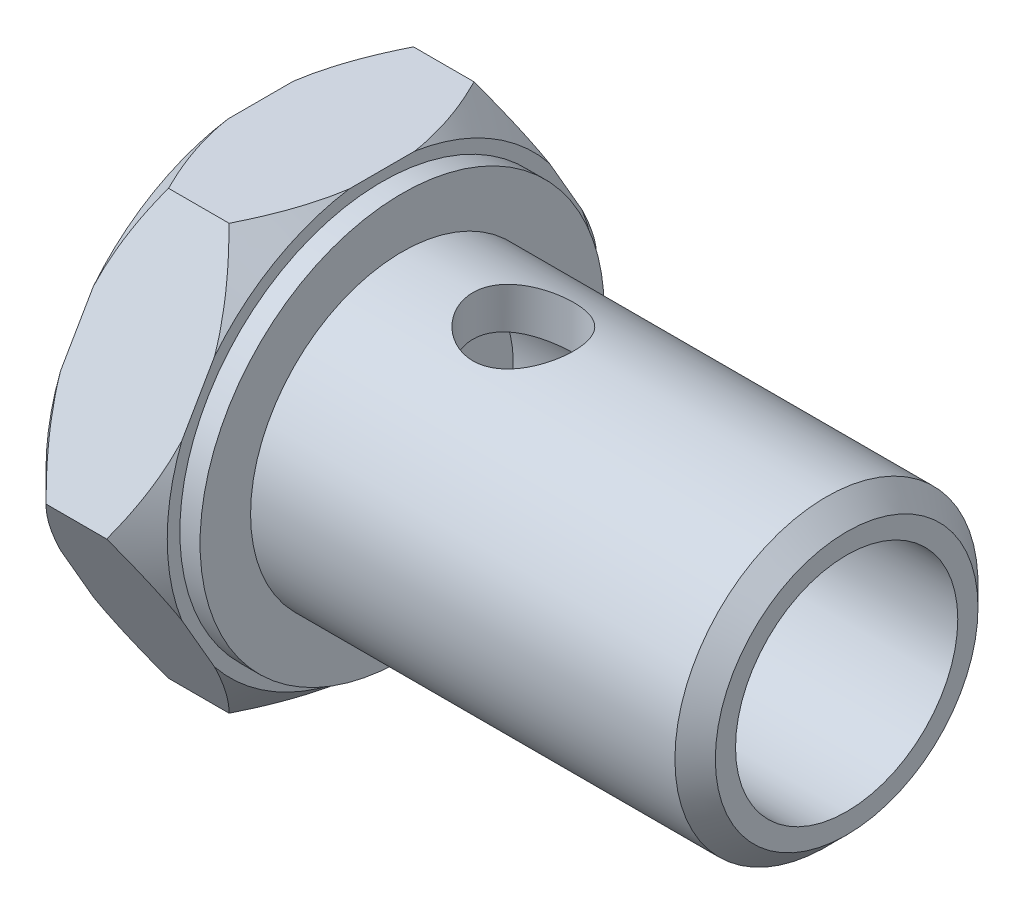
ISO-10303-21;
HEADER;
FILE_DESCRIPTION(('STEP AP214'),'2;1');
FILE_NAME('part.step','',(''),(''),'','','');
FILE_SCHEMA(('AUTOMOTIVE_DESIGN { 1 0 10303 214 1 1 1 1 }'));
ENDSEC;
DATA;
#1=APPLICATION_CONTEXT('core data for automotive mechanical design processes');
#2=APPLICATION_PROTOCOL_DEFINITION('international standard','automotive_design',2000,#1);
#3=PRODUCT_CONTEXT('',#1,'mechanical');
#4=PRODUCT('Part','Part','',(#3));
#5=PRODUCT_RELATED_PRODUCT_CATEGORY('part','',(#4));
#6=PRODUCT_DEFINITION_FORMATION('','',#4);
#7=PRODUCT_DEFINITION_CONTEXT('part definition',#1,'design');
#8=PRODUCT_DEFINITION('design','',#6,#7);
#9=PRODUCT_DEFINITION_SHAPE('','',#8);
#10=(LENGTH_UNIT() NAMED_UNIT(*) SI_UNIT(.MILLI.,.METRE.));
#11=(NAMED_UNIT(*) PLANE_ANGLE_UNIT() SI_UNIT($,.RADIAN.));
#12=(NAMED_UNIT(*) SI_UNIT($,.STERADIAN.) SOLID_ANGLE_UNIT());
#13=UNCERTAINTY_MEASURE_WITH_UNIT(LENGTH_MEASURE(1.E-05),#10,'distance_accuracy_value','');
#14=(GEOMETRIC_REPRESENTATION_CONTEXT(3) GLOBAL_UNCERTAINTY_ASSIGNED_CONTEXT((#13)) GLOBAL_UNIT_ASSIGNED_CONTEXT((#10,
#11,#12)) REPRESENTATION_CONTEXT('',''));
#15=CARTESIAN_POINT('',(0.,0.,0.));
#16=DIRECTION('',(0.,0.,1.));
#17=DIRECTION('',(1.,0.,0.));
#18=AXIS2_PLACEMENT_3D('',#15,#16,#17);
#19=CARTESIAN_POINT('',(22.,0.,0.));
#20=DIRECTION('',(1.,0.,0.));
#21=DIRECTION('',(0.,0.,-1.));
#22=AXIS2_PLACEMENT_3D('',#19,#20,#21);
#23=PLANE('',#22);
#24=CARTESIAN_POINT('',(22.,0.,0.));
#25=DIRECTION('',(1.,0.,0.));
#26=DIRECTION('',(0.,0.,-1.));
#27=AXIS2_PLACEMENT_3D('',#24,#25,#26);
#28=CIRCLE('',#27,6.49999999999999);
#29=CARTESIAN_POINT('',(22.,0.,6.49999999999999));
#30=VERTEX_POINT('',#29);
#31=EDGE_CURVE('E238',#30,#30,#28,.T.);
#32=ORIENTED_EDGE('',*,*,#31,.T.);
#33=EDGE_LOOP('',(#32));
#34=FACE_BOUND('',#33,.T.);
#35=CARTESIAN_POINT('',(22.,0.,0.));
#36=DIRECTION('',(1.,0.,0.));
#37=DIRECTION('',(0.,0.,-1.));
#38=AXIS2_PLACEMENT_3D('',#35,#36,#37);
#39=CIRCLE('',#38,5.5);
#40=CARTESIAN_POINT('',(22.,0.,-5.5));
#41=VERTEX_POINT('',#40);
#42=EDGE_CURVE('E235',#41,#41,#39,.T.);
#43=ORIENTED_EDGE('',*,*,#42,.F.);
#44=EDGE_LOOP('',(#43));
#45=FACE_BOUND('',#44,.T.);
#46=ADVANCED_FACE('F36',(#34,#45),#23,.T.);
#47=CARTESIAN_POINT('',(22.,0.,0.));
#48=DIRECTION('',(-1.,0.,0.));
#49=DIRECTION('',(0.,0.,1.));
#50=AXIS2_PLACEMENT_3D('',#47,#48,#49);
#51=CYLINDRICAL_SURFACE('',#50,7.5);
#52=CARTESIAN_POINT('',(6.00000000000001,-7.07106781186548,2.5));
#53=CARTESIAN_POINT('',(6.13617043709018,-7.07106736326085,2.50000064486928));
#54=CARTESIAN_POINT('',(6.27233699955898,-7.07504423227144,2.48883695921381));
#55=CARTESIAN_POINT('',(6.54063605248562,-7.09043935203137,2.44462782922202));
#56=CARTESIAN_POINT('',(6.67276787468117,-7.10185882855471,2.41157878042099));
#57=CARTESIAN_POINT('',(6.92906723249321,-7.13070509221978,2.32488871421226));
#58=CARTESIAN_POINT('',(7.05324982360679,-7.14812009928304,2.27128805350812));
#59=CARTESIAN_POINT('',(7.29090012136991,-7.18697805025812,2.14515407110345));
#60=CARTESIAN_POINT('',(7.40436545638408,-7.2084218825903,2.07261657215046));
#61=CARTESIAN_POINT('',(7.62179990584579,-7.25386223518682,1.90762786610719));
#62=CARTESIAN_POINT('',(7.72528857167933,-7.2779223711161,1.8145608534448));
#63=CARTESIAN_POINT('',(7.9155170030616,-7.32534662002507,1.61246916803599));
#64=CARTESIAN_POINT('',(8.00225407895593,-7.34871062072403,1.50344193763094));
#65=CARTESIAN_POINT('',(8.15869724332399,-7.39284667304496,1.26901126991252));
#66=CARTESIAN_POINT('',(8.2278999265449,-7.41353519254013,1.14325477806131));
#67=CARTESIAN_POINT('',(8.34397896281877,-7.44923966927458,0.881078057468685));
#68=CARTESIAN_POINT('',(8.39086133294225,-7.46425715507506,0.744660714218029));
#69=CARTESIAN_POINT('',(8.45933963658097,-7.48647688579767,0.470072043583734));
#70=CARTESIAN_POINT('',(8.48175861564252,-7.49393286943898,0.33212688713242));
#71=CARTESIAN_POINT('',(8.50329073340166,-7.50109020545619,0.0542446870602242));
#72=CARTESIAN_POINT('',(8.50240987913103,-7.50079355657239,-0.0856918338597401));
#73=CARTESIAN_POINT('',(8.47788936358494,-7.49265099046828,-0.357758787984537));
#74=CARTESIAN_POINT('',(8.45514367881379,-7.48510161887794,-0.489980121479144));
#75=CARTESIAN_POINT('',(8.38901754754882,-7.46367418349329,-0.74860859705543));
#76=CARTESIAN_POINT('',(8.34563570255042,-7.44979569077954,-0.875015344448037));
#77=CARTESIAN_POINT('',(8.23894670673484,-7.4168917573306,-1.12038118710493));
#78=CARTESIAN_POINT('',(8.17538515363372,-7.39780106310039,-1.23922055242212));
#79=CARTESIAN_POINT('',(8.03035073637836,-7.35645982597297,-1.46481081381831));
#80=CARTESIAN_POINT('',(7.94887289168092,-7.33420840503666,-1.57155833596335));
#81=CARTESIAN_POINT('',(7.76581401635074,-7.2876547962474,-1.77525216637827));
#82=CARTESIAN_POINT('',(7.66346710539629,-7.26330537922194,-1.87150039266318));
#83=CARTESIAN_POINT('',(7.44387818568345,-7.21618338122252,-2.04569314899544));
#84=CARTESIAN_POINT('',(7.32663388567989,-7.19341104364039,-2.12363485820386));
#85=CARTESIAN_POINT('',(7.0783659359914,-7.15176312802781,-2.25996863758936));
#86=CARTESIAN_POINT('',(6.94716967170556,-7.1329477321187,-2.31806615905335));
#87=CARTESIAN_POINT('',(6.67607151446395,-7.10204127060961,-2.41110798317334));
#88=CARTESIAN_POINT('',(6.53617329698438,-7.08994738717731,-2.44606198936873));
#89=CARTESIAN_POINT('',(6.25840411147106,-7.07449090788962,-2.4904032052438));
#90=CARTESIAN_POINT('',(6.12072643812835,-7.0707590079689,-2.50087273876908));
#91=CARTESIAN_POINT('',(5.84555962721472,-7.07141680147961,-2.4990135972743));
#92=CARTESIAN_POINT('',(5.70807045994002,-7.07580501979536,-2.48668906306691));
#93=CARTESIAN_POINT('',(5.44210758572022,-7.09184045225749,-2.44056412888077));
#94=CARTESIAN_POINT('',(5.3134864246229,-7.10323313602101,-2.40751598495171));
#95=CARTESIAN_POINT('',(5.06364098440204,-7.13171384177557,-2.32178465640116));
#96=CARTESIAN_POINT('',(4.94241802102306,-7.14880287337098,-2.26909799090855));
#97=CARTESIAN_POINT('',(4.70654894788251,-7.18742193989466,-2.14368585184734));
#98=CARTESIAN_POINT('',(4.5922333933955,-7.20907564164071,-2.07037779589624));
#99=CARTESIAN_POINT('',(4.3771348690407,-7.25414421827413,-1.90646407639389));
#100=CARTESIAN_POINT('',(4.27635590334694,-7.27755961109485,-1.81585331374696));
#101=CARTESIAN_POINT('',(4.08618003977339,-7.32487596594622,-1.61472926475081));
#102=CARTESIAN_POINT('',(3.99756402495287,-7.34874608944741,-1.50346817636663));
#103=CARTESIAN_POINT('',(3.8402096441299,-7.39317129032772,-1.26706822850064));
#104=CARTESIAN_POINT('',(3.77147057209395,-7.41372648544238,-1.14192986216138));
#105=CARTESIAN_POINT('',(3.65644973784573,-7.44911014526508,-0.881949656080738));
#106=CARTESIAN_POINT('',(3.61002180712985,-7.46397575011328,-0.747177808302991));
#107=CARTESIAN_POINT('',(3.54068064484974,-7.48646527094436,-0.471146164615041));
#108=CARTESIAN_POINT('',(3.51775892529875,-7.49409180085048,-0.329888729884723));
#109=CARTESIAN_POINT('',(3.4968448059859,-7.50104658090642,-0.0520383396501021));
#110=CARTESIAN_POINT('',(3.49773136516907,-7.50074800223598,0.0844618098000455));
#111=CARTESIAN_POINT('',(3.52164327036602,-7.49280491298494,0.355277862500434));
#112=CARTESIAN_POINT('',(3.54466682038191,-7.48516099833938,0.489593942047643));
#113=CARTESIAN_POINT('',(3.6114555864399,-7.4635228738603,0.750105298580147));
#114=CARTESIAN_POINT('',(3.65488553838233,-7.44963145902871,0.876395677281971));
#115=CARTESIAN_POINT('',(3.7609438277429,-7.41692901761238,1.11994587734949));
#116=CARTESIAN_POINT('',(3.82357563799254,-7.39811710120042,1.23720406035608));
#117=CARTESIAN_POINT('',(3.96892378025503,-7.35664672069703,1.46408504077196));
#118=CARTESIAN_POINT('',(4.05229671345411,-7.33387181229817,1.57326562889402));
#119=CARTESIAN_POINT('',(4.2356434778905,-7.28732471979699,1.77645256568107));
#120=CARTESIAN_POINT('',(4.33562260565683,-7.26355221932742,1.87045405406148));
#121=CARTESIAN_POINT('',(4.55402338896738,-7.21658199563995,2.04435452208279));
#122=CARTESIAN_POINT('',(4.67301377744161,-7.19344319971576,2.12355741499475));
#123=CARTESIAN_POINT('',(4.92333606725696,-7.15150483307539,2.26078585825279));
#124=CARTESIAN_POINT('',(5.05466473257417,-7.13270412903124,2.31881694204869));
#125=CARTESIAN_POINT('',(5.31990456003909,-7.10253335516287,2.40960957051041));
#126=CARTESIAN_POINT('',(5.45343065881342,-7.09086582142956,2.4433947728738));
#127=CARTESIAN_POINT('',(5.72464012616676,-7.07513458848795,2.48858580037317));
#128=CARTESIAN_POINT('',(5.86232204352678,-7.07106826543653,2.49999934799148));
#129=CARTESIAN_POINT('',(6.00000000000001,-7.07106781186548,2.5));
#130=B_SPLINE_CURVE_WITH_KNOTS('',3,(#52,#53,#54,#55,#56,#57,#58,#59,#60,#61,#62,#63,#64,#65,
#66,#67,#68,#69,#70,#71,#72,#73,#74,#75,#76,#77,#78,#79,#80,#81,#82,#83,#84,#85,#86,#87,#88,#89,
#90,#91,#92,#93,#94,#95,#96,#97,#98,#99,#100,#101,#102,#103,#104,#105,#106,#107,#108,#109,#110,
#111,#112,#113,#114,#115,#116,#117,#118,#119,#120,#121,#122,#123,#124,#125,#126,#127,#128,#129),
.UNSPECIFIED.,.T.,.F.,(4,2,2,2,2,2,2,2,2,2,2,2,2,2,2,2,2,2,2,2,2,2,2,2,2,2,2,2,2,2,2,2,2,2,2,2,
2,2,4),(0.,0.408001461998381,0.816070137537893,1.22334156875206,1.63070291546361,
2.0525334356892,2.4744316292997,2.90733765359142,3.34012690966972,3.75785796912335,
4.17548133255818,4.57672512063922,4.97799610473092,5.38454137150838,5.79119979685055,
6.21700435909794,6.64287449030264,7.07481599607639,7.50657628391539,7.918857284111,
8.33106339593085,8.7291098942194,9.12722697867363,9.53797144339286,9.94883714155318,
10.3794702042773,10.8100879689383,11.2378447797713,11.6654470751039,12.0729521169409,
12.4804241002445,12.8814239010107,13.2824962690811,13.6983879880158,14.1144126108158,
14.5467225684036,14.9789194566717,15.3915803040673,15.8040986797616),.UNSPECIFIED.);
#131=CARTESIAN_POINT('',(6.00000000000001,-7.07106781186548,2.5));
#132=VERTEX_POINT('',#131);
#133=EDGE_CURVE('E190',#132,#132,#130,.T.);
#134=ORIENTED_EDGE('',*,*,#133,.T.);
#135=EDGE_LOOP('',(#134));
#136=FACE_BOUND('',#135,.T.);
#137=CARTESIAN_POINT('',(6.00000000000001,7.07106781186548,2.5));
#138=CARTESIAN_POINT('',(5.86382956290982,7.07106736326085,2.50000064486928));
#139=CARTESIAN_POINT('',(5.72766300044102,7.07504423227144,2.4888369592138));
#140=CARTESIAN_POINT('',(5.45936394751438,7.09043935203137,2.44462782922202));
#141=CARTESIAN_POINT('',(5.32723212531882,7.10185882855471,2.41157878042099));
#142=CARTESIAN_POINT('',(5.07093276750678,7.13070509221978,2.32488871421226));
#143=CARTESIAN_POINT('',(4.94675017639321,7.14812009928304,2.27128805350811));
#144=CARTESIAN_POINT('',(4.7090998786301,7.18697805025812,2.14515407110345));
#145=CARTESIAN_POINT('',(4.59563454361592,7.2084218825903,2.07261657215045));
#146=CARTESIAN_POINT('',(4.37820009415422,7.25386223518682,1.90762786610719));
#147=CARTESIAN_POINT('',(4.27471142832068,7.2779223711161,1.8145608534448));
#148=CARTESIAN_POINT('',(4.08448299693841,7.32534662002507,1.61246916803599));
#149=CARTESIAN_POINT('',(3.99774592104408,7.34871062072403,1.50344193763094));
#150=CARTESIAN_POINT('',(3.84130275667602,7.39284667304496,1.26901126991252));
#151=CARTESIAN_POINT('',(3.77210007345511,7.41353519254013,1.14325477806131));
#152=CARTESIAN_POINT('',(3.65602103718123,7.44923966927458,0.881078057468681));
#153=CARTESIAN_POINT('',(3.60913866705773,7.46425715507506,0.744660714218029));
#154=CARTESIAN_POINT('',(3.54066036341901,7.48647688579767,0.470072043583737));
#155=CARTESIAN_POINT('',(3.51824138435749,7.49393286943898,0.332126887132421));
#156=CARTESIAN_POINT('',(3.49670926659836,7.50109020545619,0.0542446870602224));
#157=CARTESIAN_POINT('',(3.49759012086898,7.50079355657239,-0.0856918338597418));
#158=CARTESIAN_POINT('',(3.52211063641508,7.49265099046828,-0.357758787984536));
#159=CARTESIAN_POINT('',(3.54485632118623,7.48510161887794,-0.48998012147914));
#160=CARTESIAN_POINT('',(3.61098245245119,7.46367418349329,-0.748608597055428));
#161=CARTESIAN_POINT('',(3.65436429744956,7.44979569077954,-0.87501534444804));
#162=CARTESIAN_POINT('',(3.76105329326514,7.4168917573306,-1.12038118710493));
#163=CARTESIAN_POINT('',(3.82461484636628,7.39780106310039,-1.23922055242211));
#164=CARTESIAN_POINT('',(3.96964926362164,7.35645982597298,-1.4648108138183));
#165=CARTESIAN_POINT('',(4.05112710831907,7.33420840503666,-1.57155833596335));
#166=CARTESIAN_POINT('',(4.23418598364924,7.2876547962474,-1.77525216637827));
#167=CARTESIAN_POINT('',(4.3365328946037,7.26330537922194,-1.87150039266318));
#168=CARTESIAN_POINT('',(4.55612181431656,7.21618338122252,-2.04569314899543));
#169=CARTESIAN_POINT('',(4.67336611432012,7.19341104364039,-2.12363485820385));
#170=CARTESIAN_POINT('',(4.92163406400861,7.15176312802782,-2.25996863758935));
#171=CARTESIAN_POINT('',(5.05283032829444,7.1329477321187,-2.31806615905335));
#172=CARTESIAN_POINT('',(5.32392848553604,7.10204127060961,-2.41110798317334));
#173=CARTESIAN_POINT('',(5.46382670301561,7.08994738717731,-2.44606198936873));
#174=CARTESIAN_POINT('',(5.74159588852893,7.07449090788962,-2.4904032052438));
#175=CARTESIAN_POINT('',(5.87927356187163,7.0707590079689,-2.50087273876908));
#176=CARTESIAN_POINT('',(6.15444037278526,7.07141680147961,-2.4990135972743));
#177=CARTESIAN_POINT('',(6.29192954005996,7.07580501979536,-2.4866890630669));
#178=CARTESIAN_POINT('',(6.55789241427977,7.09184045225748,-2.44056412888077));
#179=CARTESIAN_POINT('',(6.6865135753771,7.10323313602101,-2.40751598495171));
#180=CARTESIAN_POINT('',(6.93635901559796,7.13171384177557,-2.32178465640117));
#181=CARTESIAN_POINT('',(7.05758197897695,7.14880287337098,-2.26909799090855));
#182=CARTESIAN_POINT('',(7.29345105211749,7.18742193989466,-2.14368585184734));
#183=CARTESIAN_POINT('',(7.4077666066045,7.20907564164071,-2.07037779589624));
#184=CARTESIAN_POINT('',(7.62286513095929,7.25414421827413,-1.9064640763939));
#185=CARTESIAN_POINT('',(7.72364409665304,7.27755961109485,-1.81585331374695));
#186=CARTESIAN_POINT('',(7.91381996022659,7.32487596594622,-1.61472926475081));
#187=CARTESIAN_POINT('',(8.00243597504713,7.34874608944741,-1.50346817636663));
#188=CARTESIAN_POINT('',(8.15979035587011,7.39317129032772,-1.26706822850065));
#189=CARTESIAN_POINT('',(8.22852942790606,7.41372648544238,-1.14192986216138));
#190=CARTESIAN_POINT('',(8.34355026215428,7.44911014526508,-0.881949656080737));
#191=CARTESIAN_POINT('',(8.38997819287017,7.46397575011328,-0.74717780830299));
#192=CARTESIAN_POINT('',(8.45931935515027,7.48646527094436,-0.47114616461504));
#193=CARTESIAN_POINT('',(8.48224107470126,7.49409180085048,-0.329888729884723));
#194=CARTESIAN_POINT('',(8.50315519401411,7.50104658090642,-0.052038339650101));
#195=CARTESIAN_POINT('',(8.50226863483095,7.50074800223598,0.0844618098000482));
#196=CARTESIAN_POINT('',(8.47835672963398,7.49280491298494,0.355277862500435));
#197=CARTESIAN_POINT('',(8.45533317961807,7.48516099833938,0.489593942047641));
#198=CARTESIAN_POINT('',(8.38854441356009,7.4635228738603,0.750105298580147));
#199=CARTESIAN_POINT('',(8.34511446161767,7.44963145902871,0.876395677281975));
#200=CARTESIAN_POINT('',(8.23905617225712,7.41692901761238,1.11994587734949));
#201=CARTESIAN_POINT('',(8.17642436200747,7.39811710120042,1.23720406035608));
#202=CARTESIAN_POINT('',(8.03107621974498,7.35664672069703,1.46408504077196));
#203=CARTESIAN_POINT('',(7.9477032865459,7.33387181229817,1.57326562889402));
#204=CARTESIAN_POINT('',(7.76435652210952,7.28732471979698,1.77645256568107));
#205=CARTESIAN_POINT('',(7.66437739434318,7.26355221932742,1.87045405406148));
#206=CARTESIAN_POINT('',(7.44597661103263,7.21658199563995,2.04435452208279));
#207=CARTESIAN_POINT('',(7.3269862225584,7.19344319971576,2.12355741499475));
#208=CARTESIAN_POINT('',(7.07666393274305,7.15150483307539,2.26078585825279));
#209=CARTESIAN_POINT('',(6.94533526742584,7.13270412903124,2.31881694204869));
#210=CARTESIAN_POINT('',(6.68009543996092,7.10253335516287,2.40960957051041));
#211=CARTESIAN_POINT('',(6.54656934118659,7.09086582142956,2.4433947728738));
#212=CARTESIAN_POINT('',(6.27535987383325,7.07513458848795,2.48858580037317));
#213=CARTESIAN_POINT('',(6.13767795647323,7.07106826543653,2.49999934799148));
#214=CARTESIAN_POINT('',(6.00000000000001,7.07106781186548,2.5));
#215=B_SPLINE_CURVE_WITH_KNOTS('',3,(#137,#138,#139,#140,#141,#142,#143,#144,#145,#146,#147,
#148,#149,#150,#151,#152,#153,#154,#155,#156,#157,#158,#159,#160,#161,#162,#163,#164,#165,#166,
#167,#168,#169,#170,#171,#172,#173,#174,#175,#176,#177,#178,#179,#180,#181,#182,#183,#184,#185,
#186,#187,#188,#189,#190,#191,#192,#193,#194,#195,#196,#197,#198,#199,#200,#201,#202,#203,#204,
#205,#206,#207,#208,#209,#210,#211,#212,#213,#214),.UNSPECIFIED.,.T.,.F.,(4,2,2,2,2,2,2,2,2,2,2,
2,2,2,2,2,2,2,2,2,2,2,2,2,2,2,2,2,2,2,2,2,2,2,2,2,2,2,4),(0.,0.408001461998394,0.81607013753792,
1.22334156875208,1.63070291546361,2.0525334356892,2.4744316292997,2.90733765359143,
3.34012690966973,3.75785796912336,4.17548133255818,4.57672512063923,4.97799610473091,
5.38454137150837,5.79119979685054,6.21700435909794,6.64287449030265,7.07481599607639,
7.50657628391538,7.91885728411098,8.33106339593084,8.7291098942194,9.12722697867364,
9.53797144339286,9.94883714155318,10.3794702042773,10.8100879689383,11.2378447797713,
11.6654470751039,12.0729521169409,12.4804241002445,12.8814239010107,13.2824962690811,
13.6983879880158,14.1144126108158,14.5467225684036,14.9789194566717,15.3915803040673,
15.8040986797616),.UNSPECIFIED.);
#216=CARTESIAN_POINT('',(6.00000000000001,7.07106781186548,2.5));
#217=VERTEX_POINT('',#216);
#218=EDGE_CURVE('E371',#217,#217,#215,.T.);
#219=ORIENTED_EDGE('',*,*,#218,.T.);
#220=EDGE_LOOP('',(#219));
#221=FACE_BOUND('',#220,.T.);
#222=CARTESIAN_POINT('',(21.,0.,0.));
#223=DIRECTION('',(1.,0.,0.));
#224=DIRECTION('',(0.,0.,-1.));
#225=AXIS2_PLACEMENT_3D('',#222,#223,#224);
#226=CIRCLE('',#225,7.5);
#227=CARTESIAN_POINT('',(21.,0.,7.49999999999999));
#228=VERTEX_POINT('',#227);
#229=EDGE_CURVE('E243',#228,#228,#226,.F.);
#230=ORIENTED_EDGE('',*,*,#229,.T.);
#231=EDGE_LOOP('',(#230));
#232=FACE_BOUND('',#231,.T.);
#233=CARTESIAN_POINT('',(0.,0.,0.));
#234=DIRECTION('',(-1.,0.,0.));
#235=DIRECTION('',(0.,0.,1.));
#236=AXIS2_PLACEMENT_3D('',#233,#234,#235);
#237=CIRCLE('',#236,7.5);
#238=CARTESIAN_POINT('',(0.,0.,7.5));
#239=VERTEX_POINT('',#238);
#240=EDGE_CURVE('E229',#239,#239,#237,.T.);
#241=ORIENTED_EDGE('',*,*,#240,.F.);
#242=EDGE_LOOP('',(#241));
#243=FACE_BOUND('',#242,.T.);
#244=ADVANCED_FACE('F374',(#136,#221,#232,#243),#51,.T.);
#245=CARTESIAN_POINT('',(22.,0.,0.));
#246=DIRECTION('',(-1.,0.,0.));
#247=DIRECTION('',(0.,0.,1.));
#248=AXIS2_PLACEMENT_3D('',#245,#246,#247);
#249=CYLINDRICAL_SURFACE('',#248,5.5);
#250=CARTESIAN_POINT('',(6.00000000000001,-4.89897948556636,2.5));
#251=CARTESIAN_POINT('',(6.13201451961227,-4.89898837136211,2.49999196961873));
#252=CARTESIAN_POINT('',(6.26423901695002,-4.90439430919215,2.48947537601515));
#253=CARTESIAN_POINT('',(6.52476533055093,-4.92528154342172,2.44787943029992));
#254=CARTESIAN_POINT('',(6.65305666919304,-4.94078765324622,2.41674943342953));
#255=CARTESIAN_POINT('',(6.90147690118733,-4.97972515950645,2.33545276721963));
#256=CARTESIAN_POINT('',(7.02164042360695,-5.00312000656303,2.28537376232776));
#257=CARTESIAN_POINT('',(7.25183023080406,-5.05514370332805,2.16786451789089));
#258=CARTESIAN_POINT('',(7.36185758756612,-5.08377199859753,2.10043611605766));
#259=CARTESIAN_POINT('',(7.57689426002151,-5.14541251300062,1.9447848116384));
#260=CARTESIAN_POINT('',(7.68106246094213,-5.17859023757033,1.85546486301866));
#261=CARTESIAN_POINT('',(7.87357655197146,-5.24424327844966,1.66086013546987));
#262=CARTESIAN_POINT('',(7.96191562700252,-5.27671828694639,1.55556851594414));
#263=CARTESIAN_POINT('',(8.12485113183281,-5.33938487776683,1.32512405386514));
#264=CARTESIAN_POINT('',(8.19846269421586,-5.3693621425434,1.19921119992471));
#265=CARTESIAN_POINT('',(8.32308499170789,-5.42157820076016,0.935175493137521));
#266=CARTESIAN_POINT('',(8.37410757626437,-5.4438210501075,0.797059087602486));
#267=CARTESIAN_POINT('',(8.44893433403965,-5.47688079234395,0.521404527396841));
#268=CARTESIAN_POINT('',(8.47419949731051,-5.48830796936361,0.384337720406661));
#269=CARTESIAN_POINT('',(8.50155448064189,-5.5006923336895,0.10746749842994));
#270=CARTESIAN_POINT('',(8.5036556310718,-5.50165463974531,-0.0323345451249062));
#271=CARTESIAN_POINT('',(8.48530197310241,-5.493330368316,-0.299930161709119));
#272=CARTESIAN_POINT('',(8.46646426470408,-5.48477852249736,-0.427862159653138));
#273=CARTESIAN_POINT('',(8.40959213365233,-5.45944031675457,-0.678516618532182));
#274=CARTESIAN_POINT('',(8.37155628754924,-5.44265334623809,-0.801238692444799));
#275=CARTESIAN_POINT('',(8.27697996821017,-5.4021098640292,-1.04025925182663));
#276=CARTESIAN_POINT('',(8.22016820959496,-5.37825173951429,-1.15643244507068));
#277=CARTESIAN_POINT('',(8.08995466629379,-5.32582034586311,-1.37789997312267));
#278=CARTESIAN_POINT('',(8.016546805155,-5.29724535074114,-1.48319030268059));
#279=CARTESIAN_POINT('',(7.84830048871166,-5.23541847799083,-1.68904292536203));
#280=CARTESIAN_POINT('',(7.75220270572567,-5.20197523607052,-1.78851976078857));
#281=CARTESIAN_POINT('',(7.54476575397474,-5.13581955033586,-1.97046933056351));
#282=CARTESIAN_POINT('',(7.43341836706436,-5.10310751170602,-2.05293283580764));
#283=CARTESIAN_POINT('',(7.19238010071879,-5.04059957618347,-2.20209013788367));
#284=CARTESIAN_POINT('',(7.06208750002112,-5.01100237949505,-2.26790243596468));
#285=CARTESIAN_POINT('',(6.79057933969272,-4.96057594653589,-2.37619334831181));
#286=CARTESIAN_POINT('',(6.64937339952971,-4.93973909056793,-2.41869225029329));
#287=CARTESIAN_POINT('',(6.37094357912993,-4.91119669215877,-2.47610787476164));
#288=CARTESIAN_POINT('',(6.23417537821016,-4.90264732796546,-2.49280372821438));
#289=CARTESIAN_POINT('',(5.95955340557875,-4.89722669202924,-2.50344178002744));
#290=CARTESIAN_POINT('',(5.82170017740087,-4.9003499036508,-2.49739472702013));
#291=CARTESIAN_POINT('',(5.56086346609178,-4.91703840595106,-2.46434845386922));
#292=CARTESIAN_POINT('',(5.43759134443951,-4.92972117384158,-2.43911853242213));
#293=CARTESIAN_POINT('',(5.19718480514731,-4.96289406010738,-2.37088810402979));
#294=CARTESIAN_POINT('',(5.08005202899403,-4.98338625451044,-2.32788287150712));
#295=CARTESIAN_POINT('',(4.84926952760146,-5.03098751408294,-2.2231964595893));
#296=CARTESIAN_POINT('',(4.73601925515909,-5.05835471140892,-2.16075614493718));
#297=CARTESIAN_POINT('',(4.52100079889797,-5.11631673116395,-2.01968175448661));
#298=CARTESIAN_POINT('',(4.41923818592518,-5.14691310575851,-1.94103987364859));
#299=CARTESIAN_POINT('',(4.2194373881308,-5.21158189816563,-1.76053571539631));
#300=CARTESIAN_POINT('',(4.12279553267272,-5.24569526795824,-1.65713587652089));
#301=CARTESIAN_POINT('',(3.94790177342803,-5.31079182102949,-1.4348829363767));
#302=CARTESIAN_POINT('',(3.86965301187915,-5.34177446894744,-1.31602720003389));
#303=CARTESIAN_POINT('',(3.73320503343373,-5.39763225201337,-1.06412926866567));
#304=CARTESIAN_POINT('',(3.67523961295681,-5.42243527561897,-0.930943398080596));
#305=CARTESIAN_POINT('',(3.58303908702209,-5.46259669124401,-0.655271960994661));
#306=CARTESIAN_POINT('',(3.54878688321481,-5.47796188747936,-0.512793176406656));
#307=CARTESIAN_POINT('',(3.50742482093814,-5.49660137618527,-0.234932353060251));
#308=CARTESIAN_POINT('',(3.49835661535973,-5.50074734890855,-0.0998989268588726));
#309=CARTESIAN_POINT('',(3.50213174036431,-5.49903067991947,0.169779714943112));
#310=CARTESIAN_POINT('',(3.51496979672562,-5.49317044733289,0.304425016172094));
#311=CARTESIAN_POINT('',(3.56080556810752,-5.47259382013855,0.562783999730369));
#312=CARTESIAN_POINT('',(3.59280785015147,-5.45831522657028,0.686712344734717));
#313=CARTESIAN_POINT('',(3.67487003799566,-5.42262556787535,0.927328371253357));
#314=CARTESIAN_POINT('',(3.724933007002,-5.40121329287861,1.04401482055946));
#315=CARTESIAN_POINT('',(3.84419727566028,-5.35204671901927,1.27275603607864));
#316=CARTESIAN_POINT('',(3.91416910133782,-5.32404717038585,1.3843549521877));
#317=CARTESIAN_POINT('',(4.07022082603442,-5.26486798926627,1.59471801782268));
#318=CARTESIAN_POINT('',(4.15630776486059,-5.23368696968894,1.693476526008));
#319=CARTESIAN_POINT('',(4.35048850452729,-5.16835233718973,1.88390274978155));
#320=CARTESIAN_POINT('',(4.45981332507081,-5.13416609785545,1.9743091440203));
#321=CARTESIAN_POINT('',(4.69290566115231,-5.06911813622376,2.13579923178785));
#322=CARTESIAN_POINT('',(4.81668262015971,-5.03825861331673,2.20687018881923));
#323=CARTESIAN_POINT('',(5.07706844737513,-4.98353191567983,2.32785313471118));
#324=CARTESIAN_POINT('',(5.21377154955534,-4.95972231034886,2.37759232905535));
#325=CARTESIAN_POINT('',(5.42440065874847,-4.93218350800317,2.43392297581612));
#326=CARTESIAN_POINT('',(5.49547079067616,-4.92436998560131,2.4496473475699));
#327=CARTESIAN_POINT('',(5.6389546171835,-4.91174811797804,2.47486081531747));
#328=CARTESIAN_POINT('',(5.71136727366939,-4.90693754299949,2.4843545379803));
#329=CARTESIAN_POINT('',(5.81997651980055,-4.90215466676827,2.49377025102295));
#330=CARTESIAN_POINT('',(5.8559293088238,-4.90096590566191,2.49610476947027));
#331=CARTESIAN_POINT('',(5.92791617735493,-4.89937708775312,2.49922076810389));
#332=CARTESIAN_POINT('',(5.96395025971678,-4.89897705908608,2.50000219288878));
#333=CARTESIAN_POINT('',(6.00000000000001,-4.89897948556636,2.5));
#334=B_SPLINE_CURVE_WITH_KNOTS('',3,(#250,#251,#252,#253,#254,#255,#256,#257,#258,#259,#260,
#261,#262,#263,#264,#265,#266,#267,#268,#269,#270,#271,#272,#273,#274,#275,#276,#277,#278,#279,
#280,#281,#282,#283,#284,#285,#286,#287,#288,#289,#290,#291,#292,#293,#294,#295,#296,#297,#298,
#299,#300,#301,#302,#303,#304,#305,#306,#307,#308,#309,#310,#311,#312,#313,#314,#315,#316,#317,
#318,#319,#320,#321,#322,#323,#324,#325,#326,#327,#328,#329,#330,#331,#332,#333),.UNSPECIFIED.,
.T.,.F.,(4,2,2,2,2,2,2,2,2,2,2,2,2,2,2,2,2,2,2,2,2,2,2,2,2,2,2,2,2,2,2,2,2,2,2,2,2,2,2,2,2,4),
(0.,0.395898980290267,0.792774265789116,1.18783548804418,1.5828548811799,2.00455964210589,
2.42644552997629,2.87084384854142,3.31500877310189,3.73227994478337,4.14934700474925,
4.53631095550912,4.92330360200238,5.31615183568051,5.70914413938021,6.13417892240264,
6.55944366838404,7.00393462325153,7.44803815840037,7.85988595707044,8.27153913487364,
8.64923866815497,9.02703867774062,9.42198794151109,9.81712791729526,10.2518845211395,
10.6867153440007,11.1264048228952,11.5657769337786,11.9698739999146,12.3738737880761,
12.7585157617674,13.1432230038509,13.5455235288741,13.9480002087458,14.3837526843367,
14.8197915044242,15.2592985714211,15.4786446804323,15.6978277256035,15.8059336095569,
15.9140433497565),.UNSPECIFIED.);
#335=CARTESIAN_POINT('',(6.00000000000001,-4.89897948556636,2.5));
#336=VERTEX_POINT('',#335);
#337=EDGE_CURVE('E40',#336,#336,#334,.T.);
#338=ORIENTED_EDGE('',*,*,#337,.F.);
#339=EDGE_LOOP('',(#338));
#340=FACE_BOUND('',#339,.T.);
#341=CARTESIAN_POINT('',(6.00000000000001,4.89897948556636,2.5));
#342=CARTESIAN_POINT('',(5.86798548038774,4.89898837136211,2.49999196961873));
#343=CARTESIAN_POINT('',(5.73576098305,4.90439430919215,2.48947537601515));
#344=CARTESIAN_POINT('',(5.47523466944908,4.92528154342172,2.44787943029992));
#345=CARTESIAN_POINT('',(5.34694333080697,4.94078765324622,2.41674943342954));
#346=CARTESIAN_POINT('',(5.09852309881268,4.97972515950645,2.33545276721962));
#347=CARTESIAN_POINT('',(4.97835957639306,5.00312000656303,2.28537376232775));
#348=CARTESIAN_POINT('',(4.74816976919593,5.05514370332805,2.16786451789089));
#349=CARTESIAN_POINT('',(4.63814241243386,5.08377199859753,2.10043611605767));
#350=CARTESIAN_POINT('',(4.42310573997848,5.14541251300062,1.94478481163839));
#351=CARTESIAN_POINT('',(4.31893753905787,5.17859023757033,1.85546486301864));
#352=CARTESIAN_POINT('',(4.12642344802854,5.24424327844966,1.66086013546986));
#353=CARTESIAN_POINT('',(4.03808437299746,5.2767182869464,1.55556851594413));
#354=CARTESIAN_POINT('',(3.87514886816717,5.33938487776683,1.32512405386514));
#355=CARTESIAN_POINT('',(3.80153730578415,5.3693621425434,1.1992111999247));
#356=CARTESIAN_POINT('',(3.67691500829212,5.42157820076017,0.935175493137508));
#357=CARTESIAN_POINT('',(3.62589242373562,5.4438210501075,0.797059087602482));
#358=CARTESIAN_POINT('',(3.55106566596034,5.47688079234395,0.521404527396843));
#359=CARTESIAN_POINT('',(3.52580050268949,5.48830796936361,0.38433772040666));
#360=CARTESIAN_POINT('',(3.49844551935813,5.5006923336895,0.107467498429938));
#361=CARTESIAN_POINT('',(3.49634436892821,5.50165463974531,-0.0323345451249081));
#362=CARTESIAN_POINT('',(3.51469802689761,5.493330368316,-0.299930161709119));
#363=CARTESIAN_POINT('',(3.53353573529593,5.48477852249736,-0.427862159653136));
#364=CARTESIAN_POINT('',(3.59040786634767,5.45944031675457,-0.678516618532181));
#365=CARTESIAN_POINT('',(3.62844371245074,5.44265334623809,-0.801238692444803));
#366=CARTESIAN_POINT('',(3.72302003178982,5.4021098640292,-1.04025925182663));
#367=CARTESIAN_POINT('',(3.77983179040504,5.37825173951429,-1.15643244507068));
#368=CARTESIAN_POINT('',(3.91004533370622,5.32582034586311,-1.37789997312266));
#369=CARTESIAN_POINT('',(3.98345319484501,5.29724535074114,-1.48319030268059));
#370=CARTESIAN_POINT('',(4.15169951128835,5.23541847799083,-1.68904292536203));
#371=CARTESIAN_POINT('',(4.24779729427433,5.20197523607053,-1.78851976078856));
#372=CARTESIAN_POINT('',(4.45523424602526,5.13581955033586,-1.97046933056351));
#373=CARTESIAN_POINT('',(4.56658163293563,5.10310751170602,-2.05293283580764));
#374=CARTESIAN_POINT('',(4.80761989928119,5.04059957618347,-2.20209013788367));
#375=CARTESIAN_POINT('',(4.93791249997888,5.01100237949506,-2.26790243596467));
#376=CARTESIAN_POINT('',(5.20942066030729,4.96057594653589,-2.37619334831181));
#377=CARTESIAN_POINT('',(5.35062660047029,4.93973909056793,-2.41869225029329));
#378=CARTESIAN_POINT('',(5.62905642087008,4.91119669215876,-2.47610787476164));
#379=CARTESIAN_POINT('',(5.76582462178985,4.90264732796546,-2.49280372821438));
#380=CARTESIAN_POINT('',(6.04044659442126,4.89722669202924,-2.50344178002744));
#381=CARTESIAN_POINT('',(6.17829982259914,4.9003499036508,-2.49739472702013));
#382=CARTESIAN_POINT('',(6.43913653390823,4.91703840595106,-2.46434845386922));
#383=CARTESIAN_POINT('',(6.5624086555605,4.92972117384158,-2.43911853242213));
#384=CARTESIAN_POINT('',(6.8028151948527,4.96289406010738,-2.37088810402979));
#385=CARTESIAN_POINT('',(6.91994797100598,4.98338625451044,-2.32788287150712));
#386=CARTESIAN_POINT('',(7.15073047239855,5.03098751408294,-2.2231964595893));
#387=CARTESIAN_POINT('',(7.26398074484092,5.05835471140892,-2.16075614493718));
#388=CARTESIAN_POINT('',(7.47899920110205,5.11631673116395,-2.01968175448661));
#389=CARTESIAN_POINT('',(7.58076181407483,5.14691310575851,-1.94103987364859));
#390=CARTESIAN_POINT('',(7.78056261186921,5.21158189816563,-1.76053571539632));
#391=CARTESIAN_POINT('',(7.8772044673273,5.24569526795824,-1.6571358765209));
#392=CARTESIAN_POINT('',(8.05209822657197,5.31079182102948,-1.4348829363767));
#393=CARTESIAN_POINT('',(8.13034698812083,5.34177446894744,-1.31602720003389));
#394=CARTESIAN_POINT('',(8.26679496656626,5.39763225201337,-1.06412926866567));
#395=CARTESIAN_POINT('',(8.3247603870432,5.42243527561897,-0.930943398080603));
#396=CARTESIAN_POINT('',(8.41696091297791,5.462596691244,-0.655271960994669));
#397=CARTESIAN_POINT('',(8.45121311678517,5.47796188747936,-0.512793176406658));
#398=CARTESIAN_POINT('',(8.49257517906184,5.49660137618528,-0.23493235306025));
#399=CARTESIAN_POINT('',(8.50164338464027,5.50074734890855,-0.0998989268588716));
#400=CARTESIAN_POINT('',(8.4978682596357,5.49903067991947,0.169779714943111));
#401=CARTESIAN_POINT('',(8.48503020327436,5.49317044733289,0.304425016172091));
#402=CARTESIAN_POINT('',(8.43919443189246,5.47259382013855,0.562783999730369));
#403=CARTESIAN_POINT('',(8.40719214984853,5.45831522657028,0.68671234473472));
#404=CARTESIAN_POINT('',(8.32512996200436,5.42262556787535,0.927328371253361));
#405=CARTESIAN_POINT('',(8.27506699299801,5.40121329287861,1.04401482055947));
#406=CARTESIAN_POINT('',(8.15580272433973,5.35204671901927,1.27275603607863));
#407=CARTESIAN_POINT('',(8.08583089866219,5.32404717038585,1.3843549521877));
#408=CARTESIAN_POINT('',(7.92977917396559,5.26486798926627,1.59471801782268));
#409=CARTESIAN_POINT('',(7.84369223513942,5.23368696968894,1.693476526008));
#410=CARTESIAN_POINT('',(7.64951149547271,5.16835233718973,1.88390274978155));
#411=CARTESIAN_POINT('',(7.5401866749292,5.13416609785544,1.9743091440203));
#412=CARTESIAN_POINT('',(7.30709433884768,5.06911813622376,2.13579923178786));
#413=CARTESIAN_POINT('',(7.18331737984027,5.03825861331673,2.20687018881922));
#414=CARTESIAN_POINT('',(6.92293155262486,4.98353191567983,2.32785313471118));
#415=CARTESIAN_POINT('',(6.78622845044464,4.95972231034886,2.37759232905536));
#416=CARTESIAN_POINT('',(6.57559934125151,4.93218350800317,2.43392297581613));
#417=CARTESIAN_POINT('',(6.50452920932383,4.92436998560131,2.4496473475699));
#418=CARTESIAN_POINT('',(6.36104538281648,4.91174811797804,2.47486081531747));
#419=CARTESIAN_POINT('',(6.28863272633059,4.90693754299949,2.4843545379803));
#420=CARTESIAN_POINT('',(6.18002348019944,4.90215466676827,2.49377025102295));
#421=CARTESIAN_POINT('',(6.14407069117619,4.90096590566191,2.49610476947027));
#422=CARTESIAN_POINT('',(6.07208382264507,4.89937708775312,2.49922076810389));
#423=CARTESIAN_POINT('',(6.03604974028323,4.89897705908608,2.50000219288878));
#424=CARTESIAN_POINT('',(6.00000000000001,4.89897948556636,2.5));
#425=B_SPLINE_CURVE_WITH_KNOTS('',3,(#341,#342,#343,#344,#345,#346,#347,#348,#349,#350,#351,
#352,#353,#354,#355,#356,#357,#358,#359,#360,#361,#362,#363,#364,#365,#366,#367,#368,#369,#370,
#371,#372,#373,#374,#375,#376,#377,#378,#379,#380,#381,#382,#383,#384,#385,#386,#387,#388,#389,
#390,#391,#392,#393,#394,#395,#396,#397,#398,#399,#400,#401,#402,#403,#404,#405,#406,#407,#408,
#409,#410,#411,#412,#413,#414,#415,#416,#417,#418,#419,#420,#421,#422,#423,#424),.UNSPECIFIED.,
.T.,.F.,(4,2,2,2,2,2,2,2,2,2,2,2,2,2,2,2,2,2,2,2,2,2,2,2,2,2,2,2,2,2,2,2,2,2,2,2,2,2,2,2,2,4),
(0.,0.395898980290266,0.792774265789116,1.18783548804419,1.58285488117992,2.00455964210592,
2.42644552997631,2.87084384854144,3.3150087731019,3.73227994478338,4.14934700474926,
4.53631095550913,4.92330360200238,5.31615183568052,5.70914413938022,6.13417892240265,
6.55944366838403,7.00393462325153,7.44803815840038,7.85988595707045,8.27153913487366,
8.64923866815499,9.02703867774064,9.42198794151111,9.81712791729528,10.2518845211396,
10.6867153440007,11.1264048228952,11.5657769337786,11.9698739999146,12.3738737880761,
12.7585157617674,13.1432230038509,13.5455235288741,13.9480002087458,14.3837526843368,
14.8197915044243,15.2592985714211,15.4786446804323,15.6978277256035,15.8059336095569,
15.9140433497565),.UNSPECIFIED.);
#426=CARTESIAN_POINT('',(6.00000000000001,4.89897948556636,2.5));
#427=VERTEX_POINT('',#426);
#428=EDGE_CURVE('E255',#427,#427,#425,.T.);
#429=ORIENTED_EDGE('',*,*,#428,.F.);
#430=EDGE_LOOP('',(#429));
#431=FACE_BOUND('',#430,.T.);
#432=ORIENTED_EDGE('',*,*,#42,.T.);
#433=EDGE_LOOP('',(#432));
#434=FACE_BOUND('',#433,.T.);
#435=CARTESIAN_POINT('',(0.,0.,0.));
#436=DIRECTION('',(1.,0.,0.));
#437=DIRECTION('',(0.,0.,-1.));
#438=AXIS2_PLACEMENT_3D('',#435,#436,#437);
#439=CIRCLE('',#438,5.5);
#440=CARTESIAN_POINT('',(0.,0.,-5.5));
#441=VERTEX_POINT('',#440);
#442=EDGE_CURVE('E234',#441,#441,#439,.T.);
#443=ORIENTED_EDGE('',*,*,#442,.F.);
#444=EDGE_LOOP('',(#443));
#445=FACE_BOUND('',#444,.T.);
#446=ADVANCED_FACE('F378',(#340,#431,#434,#445),#249,.F.);
#447=CARTESIAN_POINT('',(22.,0.,0.));
#448=DIRECTION('',(-1.,0.,0.));
#449=DIRECTION('',(0.,0.,1.));
#450=AXIS2_PLACEMENT_3D('',#447,#448,#449);
#451=CONICAL_SURFACE('',#450,6.49999999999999,0.785398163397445);
#452=CARTESIAN_POINT('',(21.,0.,7.49999999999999));
#453=CARTESIAN_POINT('',(21.0104166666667,0.,7.48958333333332));
#454=CARTESIAN_POINT('',(21.0208333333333,0.,7.47916666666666));
#455=CARTESIAN_POINT('',(21.0416666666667,0.,7.45833333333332));
#456=CARTESIAN_POINT('',(21.0520833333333,0.,7.44791666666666));
#457=CARTESIAN_POINT('',(21.0729166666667,0.,7.42708333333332));
#458=CARTESIAN_POINT('',(21.0833333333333,0.,7.41666666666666));
#459=CARTESIAN_POINT('',(21.1041666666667,0.,7.39583333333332));
#460=CARTESIAN_POINT('',(21.1145833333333,0.,7.38541666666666));
#461=CARTESIAN_POINT('',(21.1354166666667,0.,7.36458333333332));
#462=CARTESIAN_POINT('',(21.1458333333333,0.,7.35416666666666));
#463=CARTESIAN_POINT('',(21.1666666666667,0.,7.33333333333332));
#464=CARTESIAN_POINT('',(21.1770833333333,0.,7.32291666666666));
#465=CARTESIAN_POINT('',(21.1979166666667,0.,7.30208333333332));
#466=CARTESIAN_POINT('',(21.2083333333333,0.,7.29166666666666));
#467=CARTESIAN_POINT('',(21.2291666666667,0.,7.27083333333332));
#468=CARTESIAN_POINT('',(21.2395833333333,0.,7.26041666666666));
#469=CARTESIAN_POINT('',(21.2604166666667,0.,7.23958333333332));
#470=CARTESIAN_POINT('',(21.2708333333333,0.,7.22916666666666));
#471=CARTESIAN_POINT('',(21.2916666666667,0.,7.20833333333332));
#472=CARTESIAN_POINT('',(21.3020833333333,0.,7.19791666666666));
#473=CARTESIAN_POINT('',(21.3229166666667,0.,7.17708333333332));
#474=CARTESIAN_POINT('',(21.3333333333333,0.,7.16666666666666));
#475=CARTESIAN_POINT('',(21.3541666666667,0.,7.14583333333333));
#476=CARTESIAN_POINT('',(21.3645833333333,0.,7.13541666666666));
#477=CARTESIAN_POINT('',(21.3854166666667,0.,7.11458333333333));
#478=CARTESIAN_POINT('',(21.3958333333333,0.,7.10416666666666));
#479=CARTESIAN_POINT('',(21.4166666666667,0.,7.08333333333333));
#480=CARTESIAN_POINT('',(21.4270833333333,0.,7.07291666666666));
#481=CARTESIAN_POINT('',(21.4479166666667,0.,7.05208333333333));
#482=CARTESIAN_POINT('',(21.4583333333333,0.,7.04166666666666));
#483=CARTESIAN_POINT('',(21.4791666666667,0.,7.02083333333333));
#484=CARTESIAN_POINT('',(21.4895833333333,0.,7.01041666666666));
#485=CARTESIAN_POINT('',(21.5104166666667,0.,6.98958333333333));
#486=CARTESIAN_POINT('',(21.5208333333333,0.,6.97916666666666));
#487=CARTESIAN_POINT('',(21.5416666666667,0.,6.95833333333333));
#488=CARTESIAN_POINT('',(21.5520833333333,0.,6.94791666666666));
#489=CARTESIAN_POINT('',(21.5729166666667,0.,6.92708333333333));
#490=CARTESIAN_POINT('',(21.5833333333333,0.,6.91666666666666));
#491=CARTESIAN_POINT('',(21.6041666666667,0.,6.89583333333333));
#492=CARTESIAN_POINT('',(21.6145833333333,0.,6.88541666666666));
#493=CARTESIAN_POINT('',(21.6354166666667,0.,6.86458333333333));
#494=CARTESIAN_POINT('',(21.6458333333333,0.,6.85416666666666));
#495=CARTESIAN_POINT('',(21.6666666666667,0.,6.83333333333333));
#496=CARTESIAN_POINT('',(21.6770833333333,0.,6.82291666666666));
#497=CARTESIAN_POINT('',(21.6979166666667,0.,6.80208333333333));
#498=CARTESIAN_POINT('',(21.7083333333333,0.,6.79166666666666));
#499=CARTESIAN_POINT('',(21.7291666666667,0.,6.77083333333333));
#500=CARTESIAN_POINT('',(21.7395833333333,0.,6.76041666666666));
#501=CARTESIAN_POINT('',(21.7604166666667,0.,6.73958333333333));
#502=CARTESIAN_POINT('',(21.7708333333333,0.,6.72916666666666));
#503=CARTESIAN_POINT('',(21.7916666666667,0.,6.70833333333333));
#504=CARTESIAN_POINT('',(21.8020833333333,0.,6.69791666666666));
#505=CARTESIAN_POINT('',(21.8229166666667,0.,6.67708333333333));
#506=CARTESIAN_POINT('',(21.8333333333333,0.,6.66666666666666));
#507=CARTESIAN_POINT('',(21.8541666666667,0.,6.64583333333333));
#508=CARTESIAN_POINT('',(21.8645833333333,0.,6.63541666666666));
#509=CARTESIAN_POINT('',(21.8854166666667,0.,6.61458333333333));
#510=CARTESIAN_POINT('',(21.8958333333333,0.,6.60416666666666));
#511=CARTESIAN_POINT('',(21.9166666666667,0.,6.58333333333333));
#512=CARTESIAN_POINT('',(21.9270833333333,0.,6.57291666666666));
#513=CARTESIAN_POINT('',(21.9479166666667,0.,6.55208333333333));
#514=CARTESIAN_POINT('',(21.9583333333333,0.,6.54166666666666));
#515=CARTESIAN_POINT('',(21.9791666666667,0.,6.52083333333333));
#516=CARTESIAN_POINT('',(21.9895833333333,0.,6.51041666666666));
#517=CARTESIAN_POINT('',(22.,0.,6.49999999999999));
#518=B_SPLINE_CURVE_WITH_KNOTS('',3,(#452,#453,#454,#455,#456,#457,#458,#459,#460,#461,#462,
#463,#464,#465,#466,#467,#468,#469,#470,#471,#472,#473,#474,#475,#476,#477,#478,#479,#480,#481,
#482,#483,#484,#485,#486,#487,#488,#489,#490,#491,#492,#493,#494,#495,#496,#497,#498,#499,#500,
#501,#502,#503,#504,#505,#506,#507,#508,#509,#510,#511,#512,#513,#514,#515,#516,#517),
.UNSPECIFIED.,.F.,.F.,(4,2,2,2,2,2,2,2,2,2,2,2,2,2,2,2,2,2,2,2,2,2,2,2,2,2,2,2,2,2,2,2,4),(0.,
0.0441941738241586,0.0883883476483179,0.132582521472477,0.176776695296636,0.220970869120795,
0.265165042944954,0.309359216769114,0.353553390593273,0.397747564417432,0.441941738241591,
0.48613591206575,0.530330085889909,0.574524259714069,0.618718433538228,0.662912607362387,
0.707106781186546,0.751300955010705,0.795495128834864,0.839689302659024,0.883883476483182,
0.928077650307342,0.972271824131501,1.01646599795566,1.06066017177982,1.10485434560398,
1.14904851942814,1.1932426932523,1.23743686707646,1.28163104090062,1.32582521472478,
1.37001938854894,1.41421356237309),.UNSPECIFIED.);
#519=EDGE_CURVE('BSEAM38',#228,#30,#518,.T.);
#520=ORIENTED_EDGE('',*,*,#229,.F.);
#521=ORIENTED_EDGE('',*,*,#31,.F.);
#522=ORIENTED_EDGE('',*,*,#519,.T.);
#523=ORIENTED_EDGE('',*,*,#519,.F.);
#524=EDGE_LOOP('',(#520,#522,#521,#523));
#525=FACE_BOUND('',#524,.T.);
#526=ADVANCED_FACE('F38',(#525),#451,.T.);
#527=CARTESIAN_POINT('',(0.,0.,0.));
#528=DIRECTION('',(-1.,0.,0.));
#529=DIRECTION('',(0.,0.,1.));
#530=AXIS2_PLACEMENT_3D('',#527,#528,#529);
#531=PLANE('',#530);
#532=ORIENTED_EDGE('',*,*,#442,.T.);
#533=EDGE_LOOP('',(#532));
#534=FACE_BOUND('',#533,.T.);
#535=ADVANCED_FACE('F393',(#534),#531,.F.);
#536=CARTESIAN_POINT('',(0.,0.,0.));
#537=DIRECTION('',(-1.,0.,0.));
#538=DIRECTION('',(0.,0.,1.));
#539=AXIS2_PLACEMENT_3D('',#536,#537,#538);
#540=CIRCLE('',#539,10.);
#541=CARTESIAN_POINT('',(0.,0.,-10.));
#542=VERTEX_POINT('',#541);
#543=EDGE_CURVE('E225',#542,#542,#540,.T.);
#544=ORIENTED_EDGE('',*,*,#543,.F.);
#545=EDGE_LOOP('',(#544));
#546=FACE_BOUND('',#545,.T.);
#547=ORIENTED_EDGE('',*,*,#240,.T.);
#548=EDGE_LOOP('',(#547));
#549=FACE_BOUND('',#548,.T.);
#550=ADVANCED_FACE('F391',(#546,#549),#531,.F.);
#551=CARTESIAN_POINT('',(-1.,0.,0.));
#552=DIRECTION('',(1.,0.,0.));
#553=DIRECTION('',(0.,0.,-1.));
#554=AXIS2_PLACEMENT_3D('',#551,#552,#553);
#555=CYLINDRICAL_SURFACE('',#554,10.);
#556=CARTESIAN_POINT('',(-1.,0.,0.));
#557=DIRECTION('',(-1.,0.,0.));
#558=DIRECTION('',(0.,0.,1.));
#559=AXIS2_PLACEMENT_3D('',#556,#557,#558);
#560=CIRCLE('',#559,10.);
#561=CARTESIAN_POINT('',(-1.,0.,-10.));
#562=VERTEX_POINT('',#561);
#563=EDGE_CURVE('E226',#562,#562,#560,.T.);
#564=CARTESIAN_POINT('',(-1.,0.,-10.));
#565=CARTESIAN_POINT('',(-0.989583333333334,0.,-10.));
#566=CARTESIAN_POINT('',(-0.979166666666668,0.,-10.));
#567=CARTESIAN_POINT('',(-0.958333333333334,0.,-10.));
#568=CARTESIAN_POINT('',(-0.947916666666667,0.,-10.));
#569=CARTESIAN_POINT('',(-0.927083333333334,0.,-10.));
#570=CARTESIAN_POINT('',(-0.916666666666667,0.,-10.));
#571=CARTESIAN_POINT('',(-0.895833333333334,0.,-10.));
#572=CARTESIAN_POINT('',(-0.885416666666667,0.,-10.));
#573=CARTESIAN_POINT('',(-0.864583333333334,0.,-10.));
#574=CARTESIAN_POINT('',(-0.854166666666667,0.,-10.));
#575=CARTESIAN_POINT('',(-0.833333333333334,0.,-10.));
#576=CARTESIAN_POINT('',(-0.822916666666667,0.,-10.));
#577=CARTESIAN_POINT('',(-0.802083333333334,0.,-10.));
#578=CARTESIAN_POINT('',(-0.791666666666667,0.,-10.));
#579=CARTESIAN_POINT('',(-0.770833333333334,0.,-10.));
#580=CARTESIAN_POINT('',(-0.760416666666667,0.,-10.));
#581=CARTESIAN_POINT('',(-0.739583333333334,0.,-10.));
#582=CARTESIAN_POINT('',(-0.729166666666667,0.,-10.));
#583=CARTESIAN_POINT('',(-0.708333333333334,0.,-10.));
#584=CARTESIAN_POINT('',(-0.697916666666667,0.,-10.));
#585=CARTESIAN_POINT('',(-0.677083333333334,0.,-10.));
#586=CARTESIAN_POINT('',(-0.666666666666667,0.,-10.));
#587=CARTESIAN_POINT('',(-0.645833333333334,0.,-10.));
#588=CARTESIAN_POINT('',(-0.635416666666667,0.,-10.));
#589=CARTESIAN_POINT('',(-0.614583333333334,0.,-10.));
#590=CARTESIAN_POINT('',(-0.604166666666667,0.,-10.));
#591=CARTESIAN_POINT('',(-0.583333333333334,0.,-10.));
#592=CARTESIAN_POINT('',(-0.572916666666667,0.,-10.));
#593=CARTESIAN_POINT('',(-0.552083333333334,0.,-10.));
#594=CARTESIAN_POINT('',(-0.541666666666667,0.,-10.));
#595=CARTESIAN_POINT('',(-0.520833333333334,0.,-10.));
#596=CARTESIAN_POINT('',(-0.510416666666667,0.,-10.));
#597=CARTESIAN_POINT('',(-0.489583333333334,0.,-10.));
#598=CARTESIAN_POINT('',(-0.479166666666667,0.,-10.));
#599=CARTESIAN_POINT('',(-0.458333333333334,0.,-10.));
#600=CARTESIAN_POINT('',(-0.447916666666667,0.,-10.));
#601=CARTESIAN_POINT('',(-0.427083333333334,0.,-10.));
#602=CARTESIAN_POINT('',(-0.416666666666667,0.,-10.));
#603=CARTESIAN_POINT('',(-0.395833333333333,0.,-10.));
#604=CARTESIAN_POINT('',(-0.385416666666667,0.,-10.));
#605=CARTESIAN_POINT('',(-0.364583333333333,0.,-10.));
#606=CARTESIAN_POINT('',(-0.354166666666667,0.,-10.));
#607=CARTESIAN_POINT('',(-0.333333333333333,0.,-10.));
#608=CARTESIAN_POINT('',(-0.322916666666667,0.,-10.));
#609=CARTESIAN_POINT('',(-0.302083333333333,0.,-10.));
#610=CARTESIAN_POINT('',(-0.291666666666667,0.,-10.));
#611=CARTESIAN_POINT('',(-0.270833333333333,0.,-10.));
#612=CARTESIAN_POINT('',(-0.260416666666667,0.,-10.));
#613=CARTESIAN_POINT('',(-0.239583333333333,0.,-10.));
#614=CARTESIAN_POINT('',(-0.229166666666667,0.,-10.));
#615=CARTESIAN_POINT('',(-0.208333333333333,0.,-10.));
#616=CARTESIAN_POINT('',(-0.197916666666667,0.,-10.));
#617=CARTESIAN_POINT('',(-0.177083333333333,0.,-10.));
#618=CARTESIAN_POINT('',(-0.166666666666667,0.,-10.));
#619=CARTESIAN_POINT('',(-0.145833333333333,0.,-10.));
#620=CARTESIAN_POINT('',(-0.135416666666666,0.,-10.));
#621=CARTESIAN_POINT('',(-0.114583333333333,0.,-10.));
#622=CARTESIAN_POINT('',(-0.104166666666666,0.,-10.));
#623=CARTESIAN_POINT('',(-0.0833333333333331,0.,-10.));
#624=CARTESIAN_POINT('',(-0.0729166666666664,0.,-10.));
#625=CARTESIAN_POINT('',(-0.0520833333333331,0.,-10.));
#626=CARTESIAN_POINT('',(-0.0416666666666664,0.,-10.));
#627=CARTESIAN_POINT('',(-0.0208333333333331,0.,-10.));
#628=CARTESIAN_POINT('',(-0.0104166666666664,0.,-10.));
#629=CARTESIAN_POINT('',(0.,0.,-10.));
#630=B_SPLINE_CURVE_WITH_KNOTS('',3,(#564,#565,#566,#567,#568,#569,#570,#571,#572,#573,#574,
#575,#576,#577,#578,#579,#580,#581,#582,#583,#584,#585,#586,#587,#588,#589,#590,#591,#592,#593,
#594,#595,#596,#597,#598,#599,#600,#601,#602,#603,#604,#605,#606,#607,#608,#609,#610,#611,#612,
#613,#614,#615,#616,#617,#618,#619,#620,#621,#622,#623,#624,#625,#626,#627,#628,#629),
.UNSPECIFIED.,.F.,.F.,(4,2,2,2,2,2,2,2,2,2,2,2,2,2,2,2,2,2,2,2,2,2,2,2,2,2,2,2,2,2,2,2,4),(0.,
0.0312500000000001,0.0625000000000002,0.0937500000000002,0.125,0.15625,0.1875,0.21875,0.25,
0.28125,0.3125,0.34375,0.375000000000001,0.406250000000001,0.437500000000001,0.468750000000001,
0.500000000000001,0.531250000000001,0.562500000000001,0.593750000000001,0.625000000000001,
0.656250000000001,0.687500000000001,0.718750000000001,0.750000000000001,0.781250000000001,
0.812500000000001,0.843750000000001,0.875000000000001,0.906250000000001,0.937500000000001,
0.968750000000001,1.),.UNSPECIFIED.);
#631=EDGE_CURVE('BSEAM387',#562,#542,#630,.T.);
#632=ORIENTED_EDGE('',*,*,#563,.F.);
#633=ORIENTED_EDGE('',*,*,#543,.T.);
#634=ORIENTED_EDGE('',*,*,#631,.T.);
#635=ORIENTED_EDGE('',*,*,#631,.F.);
#636=EDGE_LOOP('',(#632,#634,#633,#635));
#637=FACE_BOUND('',#636,.T.);
#638=ADVANCED_FACE('F387',(#637),#555,.T.);
#639=CARTESIAN_POINT('',(-1.,0.,0.));
#640=DIRECTION('',(-1.,0.,0.));
#641=DIRECTION('',(0.,0.,1.));
#642=AXIS2_PLACEMENT_3D('',#639,#640,#641);
#643=PLANE('',#642);
#644=DIRECTION('',(0.,0.866025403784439,0.5));
#645=VECTOR('',#644,1.);
#646=CARTESIAN_POINT('',(-1.,-10.5,6.06217782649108));
#647=LINE('',#646,#645);
#648=CARTESIAN_POINT('',(-1.,-6.65363805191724,8.28287593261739));
#649=VERTEX_POINT('',#648);
#650=CARTESIAN_POINT('',(-1.,-3.84636194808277,9.90365754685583));
#651=VERTEX_POINT('',#650);
#652=EDGE_CURVE('E355',#649,#651,#647,.T.);
#653=ORIENTED_EDGE('',*,*,#652,.F.);
#654=CARTESIAN_POINT('',(-1.,0.,0.));
#655=DIRECTION('',(1.,0.,0.));
#656=DIRECTION('',(0.,0.,-1.));
#657=AXIS2_PLACEMENT_3D('',#654,#655,#656);
#658=CIRCLE('',#657,10.6243556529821);
#659=CARTESIAN_POINT('',(-1.,-10.5,1.62078161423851));
#660=VERTEX_POINT('',#659);
#661=EDGE_CURVE('E365',#649,#660,#658,.T.);
#662=ORIENTED_EDGE('',*,*,#661,.T.);
#663=DIRECTION('',(0.,0.,1.));
#664=VECTOR('',#663,1.);
#665=CARTESIAN_POINT('',(-1.,-10.5,-6.06217782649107));
#666=LINE('',#665,#664);
#667=CARTESIAN_POINT('',(-1.,-10.5,-1.62078161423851));
#668=VERTEX_POINT('',#667);
#669=EDGE_CURVE('E198',#668,#660,#666,.T.);
#670=ORIENTED_EDGE('',*,*,#669,.F.);
#671=CARTESIAN_POINT('',(-1.,-6.65363805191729,-8.28287593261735));
#672=VERTEX_POINT('',#671);
#673=EDGE_CURVE('E189',#668,#672,#658,.T.);
#674=ORIENTED_EDGE('',*,*,#673,.T.);
#675=DIRECTION('',(0.,-0.866025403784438,0.5));
#676=VECTOR('',#675,1.);
#677=CARTESIAN_POINT('',(-1.,0.,-12.1243556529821));
#678=LINE('',#677,#676);
#679=CARTESIAN_POINT('',(-1.,-3.84636194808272,-9.90365754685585));
#680=VERTEX_POINT('',#679);
#681=EDGE_CURVE('E188',#680,#672,#678,.T.);
#682=ORIENTED_EDGE('',*,*,#681,.F.);
#683=CARTESIAN_POINT('',(-1.,3.84636194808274,-9.90365754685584));
#684=VERTEX_POINT('',#683);
#685=EDGE_CURVE('E169',#680,#684,#658,.T.);
#686=ORIENTED_EDGE('',*,*,#685,.T.);
#687=DIRECTION('',(0.,-0.866025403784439,-0.5));
#688=VECTOR('',#687,1.);
#689=CARTESIAN_POINT('',(-1.,10.5,-6.06217782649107));
#690=LINE('',#689,#688);
#691=CARTESIAN_POINT('',(-1.,6.65363805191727,-8.28287593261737));
#692=VERTEX_POINT('',#691);
#693=EDGE_CURVE('E185',#692,#684,#690,.T.);
#694=ORIENTED_EDGE('',*,*,#693,.F.);
#695=CARTESIAN_POINT('',(-1.,10.5,-1.62078161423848));
#696=VERTEX_POINT('',#695);
#697=EDGE_CURVE('E192',#692,#696,#658,.T.);
#698=ORIENTED_EDGE('',*,*,#697,.T.);
#699=DIRECTION('',(0.,0.,-1.));
#700=VECTOR('',#699,1.);
#701=CARTESIAN_POINT('',(-1.,10.5,6.06217782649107));
#702=LINE('',#701,#700);
#703=CARTESIAN_POINT('',(-1.,10.5,1.62078161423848));
#704=VERTEX_POINT('',#703);
#705=EDGE_CURVE('E196',#704,#696,#702,.T.);
#706=ORIENTED_EDGE('',*,*,#705,.F.);
#707=CARTESIAN_POINT('',(-1.,6.65363805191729,8.28287593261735));
#708=VERTEX_POINT('',#707);
#709=EDGE_CURVE('E65',#704,#708,#658,.T.);
#710=ORIENTED_EDGE('',*,*,#709,.T.);
#711=DIRECTION('',(0.,0.866025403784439,-0.5));
#712=VECTOR('',#711,1.);
#713=CARTESIAN_POINT('',(-1.,0.,12.1243556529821));
#714=LINE('',#713,#712);
#715=CARTESIAN_POINT('',(-1.,3.84636194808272,9.90365754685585));
#716=VERTEX_POINT('',#715);
#717=EDGE_CURVE('E201',#716,#708,#714,.T.);
#718=ORIENTED_EDGE('',*,*,#717,.F.);
#719=EDGE_CURVE('E57',#716,#651,#658,.T.);
#720=ORIENTED_EDGE('',*,*,#719,.T.);
#721=EDGE_LOOP('',(#653,#662,#670,#674,#682,#686,#694,#698,#706,#710,#718,#720));
#722=FACE_BOUND('',#721,.T.);
#723=ORIENTED_EDGE('',*,*,#563,.T.);
#724=EDGE_LOOP('',(#723));
#725=FACE_BOUND('',#724,.T.);
#726=ADVANCED_FACE('F182',(#722,#725),#643,.F.);
#727=CARTESIAN_POINT('',(-7.00000000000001,-10.5,6.06217782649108));
#728=DIRECTION('',(0.,0.5,-0.866025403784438));
#729=DIRECTION('',(0.,0.866025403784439,0.5));
#730=AXIS2_PLACEMENT_3D('',#727,#728,#729);
#731=PLANE('',#730);
#732=DIRECTION('',(1.,0.,0.));
#733=VECTOR('',#732,1.);
#734=CARTESIAN_POINT('',(-7.00000000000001,-10.5,6.06217782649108));
#735=LINE('',#734,#733);
#736=CARTESIAN_POINT('',(-5.50000000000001,-10.5,6.06217782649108));
#737=VERTEX_POINT('',#736);
#738=CARTESIAN_POINT('',(-2.5,-10.5,6.06217782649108));
#739=VERTEX_POINT('',#738);
#740=EDGE_CURVE('E208',#737,#739,#735,.T.);
#741=ORIENTED_EDGE('',*,*,#740,.T.);
#742=CARTESIAN_POINT('',(-8.29958810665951,-17.8302750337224,1.83004156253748));
#743=CARTESIAN_POINT('',(-8.06674902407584,-17.581439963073,1.97370655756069));
#744=CARTESIAN_POINT('',(-7.83530406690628,-17.3316175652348,2.11794158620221));
#745=CARTESIAN_POINT('',(-7.37573638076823,-16.8296560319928,2.40774921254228));
#746=CARTESIAN_POINT('',(-7.14761395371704,-16.5775166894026,2.55332192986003));
#747=CARTESIAN_POINT('',(-6.69473112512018,-16.0700228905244,2.84632361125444));
#748=CARTESIAN_POINT('',(-6.46997998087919,-15.8146622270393,2.99375615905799));
#749=CARTESIAN_POINT('',(-6.02512753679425,-15.3009271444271,3.29036124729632));
#750=CARTESIAN_POINT('',(-5.80502611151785,-15.0425528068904,3.43953374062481));
#751=CARTESIAN_POINT('',(-5.3643557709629,-14.5151312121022,3.74404074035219));
#752=CARTESIAN_POINT('',(-5.14394219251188,-14.2459863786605,3.89943158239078));
#753=CARTESIAN_POINT('',(-4.71021287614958,-13.7034440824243,4.21266852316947));
#754=CARTESIAN_POINT('',(-4.49689686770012,-13.4300467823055,4.37051452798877));
#755=CARTESIAN_POINT('',(-4.07911579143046,-12.8785410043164,4.68892653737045));
#756=CARTESIAN_POINT('',(-3.87464334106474,-12.6004367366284,4.84949011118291));
#757=CARTESIAN_POINT('',(-3.47641973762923,-12.0385518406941,5.17389450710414));
#758=CARTESIAN_POINT('',(-3.28266722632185,-11.7547719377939,5.33773491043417));
#759=CARTESIAN_POINT('',(-2.90384787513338,-11.1735462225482,5.67330573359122));
#760=CARTESIAN_POINT('',(-2.7191150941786,-10.8759360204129,5.84513106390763));
#761=CARTESIAN_POINT('',(-2.36726193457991,-10.2728851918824,6.1933026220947));
#762=CARTESIAN_POINT('',(-2.20014406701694,-9.96744345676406,6.36964949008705));
#763=CARTESIAN_POINT('',(-1.88902869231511,-9.3497344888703,6.72628392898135));
#764=CARTESIAN_POINT('',(-1.74491088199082,-9.03751317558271,6.90654498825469));
#765=CARTESIAN_POINT('',(-1.48426591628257,-8.40450312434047,7.27201351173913));
#766=CARTESIAN_POINT('',(-1.36773043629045,-8.08371700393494,7.45721946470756));
#767=CARTESIAN_POINT('',(-1.18777354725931,-7.49777893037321,7.79551096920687));
#768=CARTESIAN_POINT('',(-1.11842351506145,-7.23400030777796,7.94780362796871));
#769=CARTESIAN_POINT('',(-1.00446994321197,-6.70243937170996,8.25470047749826));
#770=CARTESIAN_POINT('',(-0.959862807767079,-6.43465764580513,8.40930432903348));
#771=CARTESIAN_POINT('',(-0.897686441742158,-5.89719287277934,8.71960976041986));
#772=CARTESIAN_POINT('',(-0.880069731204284,-5.62751400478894,8.87530892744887));
#773=CARTESIAN_POINT('',(-0.872691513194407,-5.08786232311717,9.1868769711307));
#774=CARTESIAN_POINT('',(-0.882930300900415,-4.81788950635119,9.34274584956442));
#775=CARTESIAN_POINT('',(-0.930632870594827,-4.28048467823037,9.65301667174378));
#776=CARTESIAN_POINT('',(-0.968026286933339,-4.01304790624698,9.80742136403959));
#777=CARTESIAN_POINT('',(-1.06803482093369,-3.48176448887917,10.1141579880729));
#778=CARTESIAN_POINT('',(-1.13065202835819,-3.2179181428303,10.2664897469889));
#779=CARTESIAN_POINT('',(-1.27853107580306,-2.69423992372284,10.5688355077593));
#780=CARTESIAN_POINT('',(-1.36386091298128,-2.434422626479,10.7188410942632));
#781=CARTESIAN_POINT('',(-1.55392243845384,-1.92024466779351,11.0157018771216));
#782=CARTESIAN_POINT('',(-1.65865320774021,-1.66588374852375,11.1625572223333));
#783=CARTESIAN_POINT('',(-1.92474397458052,-1.07294565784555,11.5048901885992));
#784=CARTESIAN_POINT('',(-2.09297837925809,-0.736691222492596,11.6990267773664));
#785=CARTESIAN_POINT('',(-2.45295837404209,-0.0736773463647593,12.0818180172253));
#786=CARTESIAN_POINT('',(-2.64471706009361,0.253076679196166,12.2704695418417));
#787=CARTESIAN_POINT('',(-3.04685862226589,0.898680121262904,12.6432088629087));
#788=CARTESIAN_POINT('',(-3.25727920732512,1.21751178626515,12.8272864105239));
#789=CARTESIAN_POINT('',(-3.69234229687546,1.84768196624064,13.191115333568));
#790=CARTESIAN_POINT('',(-3.91698219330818,2.15902184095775,13.3708674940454));
#791=CARTESIAN_POINT('',(-4.37856408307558,2.77679998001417,13.7275418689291));
#792=CARTESIAN_POINT('',(-4.61555816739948,3.08320891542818,13.9044471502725));
#793=CARTESIAN_POINT('',(-5.09859119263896,3.69062891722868,14.2551412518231));
#794=CARTESIAN_POINT('',(-5.34463047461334,3.99163977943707,14.4289299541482));
#795=CARTESIAN_POINT('',(-5.84373933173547,4.58876718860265,14.7736816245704));
#796=CARTESIAN_POINT('',(-6.09680132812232,4.88488850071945,14.9446473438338));
#797=CARTESIAN_POINT('',(-6.60885916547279,5.47323720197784,15.2843306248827));
#798=CARTESIAN_POINT('',(-6.8678548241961,5.76546471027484,15.4530482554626));
#799=CARTESIAN_POINT('',(-7.22580718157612,6.16328137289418,15.682727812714));
#800=CARTESIAN_POINT('',(-7.32264528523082,6.2703062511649,15.7445186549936));
#801=CARTESIAN_POINT('',(-7.51695467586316,6.48393473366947,15.8678571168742));
#802=CARTESIAN_POINT('',(-7.61442600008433,6.59053831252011,15.9294047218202));
#803=CARTESIAN_POINT('',(-7.80953576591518,6.80288533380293,16.0520033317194));
#804=CARTESIAN_POINT('',(-7.90717170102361,6.90863050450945,16.1130553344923));
#805=CARTESIAN_POINT('',(-8.10298290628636,7.11973509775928,16.2349366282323));
#806=CARTESIAN_POINT('',(-8.20115814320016,7.22509454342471,16.2957659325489));
#807=CARTESIAN_POINT('',(-8.29958810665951,7.33027503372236,16.3564919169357));
#808=B_SPLINE_CURVE_WITH_KNOTS('',3,(#742,#743,#744,#745,#746,#747,#748,#749,#750,#751,#752,
#753,#754,#755,#756,#757,#758,#759,#760,#761,#762,#763,#764,#765,#766,#767,#768,#769,#770,#771,
#772,#773,#774,#775,#776,#777,#778,#779,#780,#781,#782,#783,#784,#785,#786,#787,#788,#789,#790,
#791,#792,#793,#794,#795,#796,#797,#798,#799,#800,#801,#802,#803,#804,#805,#806,#807),
.UNSPECIFIED.,.F.,.F.,(4,2,2,2,2,2,2,2,2,2,2,2,2,2,2,2,2,2,2,2,2,2,2,2,2,2,2,2,2,2,2,2,4),(0.,
1.10949079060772,2.21908177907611,3.33130448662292,4.44349715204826,5.58644103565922,
6.72934130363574,7.87126830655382,9.01305029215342,10.1831165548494,11.3533493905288,
12.5172450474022,13.6807889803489,14.6170388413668,15.5531526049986,16.4876177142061,
17.4220927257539,18.354154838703,19.2862941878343,20.2212561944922,21.1561739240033,
22.4245680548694,23.6936715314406,24.9654005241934,26.2368969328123,27.5142738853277,
28.7916990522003,30.06779550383,31.3438528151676,31.8148617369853,32.2858986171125,
32.754916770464,33.2239063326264),.UNSPECIFIED.);
#809=EDGE_CURVE('E280',#739,#649,#808,.T.);
#810=ORIENTED_EDGE('',*,*,#809,.T.);
#811=ORIENTED_EDGE('',*,*,#652,.T.);
#812=CARTESIAN_POINT('',(-2.5,0.,12.1243556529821));
#813=VERTEX_POINT('',#812);
#814=EDGE_CURVE('E456',#651,#813,#808,.T.);
#815=ORIENTED_EDGE('',*,*,#814,.T.);
#816=DIRECTION('',(1.,0.,0.));
#817=VECTOR('',#816,1.);
#818=CARTESIAN_POINT('',(-7.00000000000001,0.,12.1243556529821));
#819=LINE('',#818,#817);
#820=CARTESIAN_POINT('',(-5.50000000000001,0.,12.1243556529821));
#821=VERTEX_POINT('',#820);
#822=EDGE_CURVE('E222',#821,#813,#819,.T.);
#823=ORIENTED_EDGE('',*,*,#822,.F.);
#824=CARTESIAN_POINT('',(0.299588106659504,7.33027503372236,16.3564919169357));
#825=CARTESIAN_POINT('',(0.0667490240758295,7.08143996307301,16.2128269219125));
#826=CARTESIAN_POINT('',(-0.164695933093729,6.83161756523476,16.068591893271));
#827=CARTESIAN_POINT('',(-0.624263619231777,6.32965603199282,15.778784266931));
#828=CARTESIAN_POINT('',(-0.852386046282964,6.07751668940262,15.6332115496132));
#829=CARTESIAN_POINT('',(-1.30526887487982,5.5700228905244,15.3402098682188));
#830=CARTESIAN_POINT('',(-1.53002001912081,5.31466222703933,15.1927773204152));
#831=CARTESIAN_POINT('',(-1.97487246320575,4.80092714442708,14.8961722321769));
#832=CARTESIAN_POINT('',(-2.19497388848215,4.54255280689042,14.7469997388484));
#833=CARTESIAN_POINT('',(-2.63564422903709,4.01513121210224,14.4424927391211));
#834=CARTESIAN_POINT('',(-2.85605780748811,3.7459863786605,14.2871018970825));
#835=CARTESIAN_POINT('',(-3.28978712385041,3.20344408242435,13.9738649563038));
#836=CARTESIAN_POINT('',(-3.50310313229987,2.93004678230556,13.8160189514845));
#837=CARTESIAN_POINT('',(-3.92088420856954,2.37854100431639,13.4976069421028));
#838=CARTESIAN_POINT('',(-4.12535665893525,2.10043673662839,13.3370433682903));
#839=CARTESIAN_POINT('',(-4.52358026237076,1.53855184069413,13.0126389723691));
#840=CARTESIAN_POINT('',(-4.71733277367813,1.25477193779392,12.8487985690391));
#841=CARTESIAN_POINT('',(-5.0961521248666,0.673546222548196,12.513227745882));
#842=CARTESIAN_POINT('',(-5.28088490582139,0.375936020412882,12.3414024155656));
#843=CARTESIAN_POINT('',(-5.63273806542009,-0.227114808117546,11.9932308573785));
#844=CARTESIAN_POINT('',(-5.79985593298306,-0.532556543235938,11.8168839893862));
#845=CARTESIAN_POINT('',(-6.11097130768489,-1.15026551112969,11.4602495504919));
#846=CARTESIAN_POINT('',(-6.25508911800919,-1.46248682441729,11.2799884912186));
#847=CARTESIAN_POINT('',(-6.51573408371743,-2.09549687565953,10.9145199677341));
#848=CARTESIAN_POINT('',(-6.63226956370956,-2.41628299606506,10.7293140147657));
#849=CARTESIAN_POINT('',(-6.8122264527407,-3.0022210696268,10.3910225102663));
#850=CARTESIAN_POINT('',(-6.88157648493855,-3.26599969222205,10.2387298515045));
#851=CARTESIAN_POINT('',(-6.99553005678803,-3.79756062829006,9.93183300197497));
#852=CARTESIAN_POINT('',(-7.04013719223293,-4.06534235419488,9.77722915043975));
#853=CARTESIAN_POINT('',(-7.10231355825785,-4.60280712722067,9.46692371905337));
#854=CARTESIAN_POINT('',(-7.11993026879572,-4.87248599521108,9.31122455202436));
#855=CARTESIAN_POINT('',(-7.1273084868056,-5.41213767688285,8.99965650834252));
#856=CARTESIAN_POINT('',(-7.11706969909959,-5.68211049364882,8.8437876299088));
#857=CARTESIAN_POINT('',(-7.06936712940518,-6.21951532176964,8.53351680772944));
#858=CARTESIAN_POINT('',(-7.03197371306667,-6.48695209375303,8.37911211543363));
#859=CARTESIAN_POINT('',(-6.93196517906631,-7.01823551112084,8.07237549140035));
#860=CARTESIAN_POINT('',(-6.86934797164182,-7.2820818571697,7.92004373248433));
#861=CARTESIAN_POINT('',(-6.72146892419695,-7.80576007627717,7.6176979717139));
#862=CARTESIAN_POINT('',(-6.63613908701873,-8.065577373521,7.46769238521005));
#863=CARTESIAN_POINT('',(-6.44607756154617,-8.57975533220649,7.17083160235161));
#864=CARTESIAN_POINT('',(-6.3413467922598,-8.83411625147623,7.0239762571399));
#865=CARTESIAN_POINT('',(-6.07525602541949,-9.42705434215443,6.68164329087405));
#866=CARTESIAN_POINT('',(-5.90702162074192,-9.7633087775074,6.48750670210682));
#867=CARTESIAN_POINT('',(-5.54704162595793,-10.4263226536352,6.10471546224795));
#868=CARTESIAN_POINT('',(-5.35528293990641,-10.7530766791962,5.91606393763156));
#869=CARTESIAN_POINT('',(-4.95314137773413,-11.3986801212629,5.54332461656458));
#870=CARTESIAN_POINT('',(-4.74272079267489,-11.7175117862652,5.35924706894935));
#871=CARTESIAN_POINT('',(-4.30765770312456,-12.3476819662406,4.99541814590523));
#872=CARTESIAN_POINT('',(-4.08301780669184,-12.6590218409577,4.81566598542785));
#873=CARTESIAN_POINT('',(-3.62143591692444,-13.2767999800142,4.45899161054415));
#874=CARTESIAN_POINT('',(-3.38444183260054,-13.5832089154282,4.28208632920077));
#875=CARTESIAN_POINT('',(-2.90140880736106,-14.1906289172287,3.93139222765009));
#876=CARTESIAN_POINT('',(-2.65536952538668,-14.4916397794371,3.75760352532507));
#877=CARTESIAN_POINT('',(-2.15626066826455,-15.0887671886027,3.41285185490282));
#878=CARTESIAN_POINT('',(-1.90319867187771,-15.3848885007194,3.2418861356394));
#879=CARTESIAN_POINT('',(-1.39114083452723,-15.9732372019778,2.9022028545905));
#880=CARTESIAN_POINT('',(-1.1321451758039,-16.2654647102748,2.73348522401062));
#881=CARTESIAN_POINT('',(-0.774192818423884,-16.6632813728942,2.50380566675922));
#882=CARTESIAN_POINT('',(-0.677354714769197,-16.7703062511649,2.44201482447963));
#883=CARTESIAN_POINT('',(-0.483045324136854,-16.9839347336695,2.31867636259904));
#884=CARTESIAN_POINT('',(-0.385573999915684,-17.0905383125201,2.25712875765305));
#885=CARTESIAN_POINT('',(-0.190464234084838,-17.3028853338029,2.1345301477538));
#886=CARTESIAN_POINT('',(-0.0928282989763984,-17.4086305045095,2.07347814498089));
#887=CARTESIAN_POINT('',(0.102982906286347,-17.6197350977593,1.95159685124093));
#888=CARTESIAN_POINT('',(0.201158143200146,-17.7250945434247,1.89076754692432));
#889=CARTESIAN_POINT('',(0.299588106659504,-17.8302750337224,1.83004156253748));
#890=B_SPLINE_CURVE_WITH_KNOTS('',3,(#824,#825,#826,#827,#828,#829,#830,#831,#832,#833,#834,
#835,#836,#837,#838,#839,#840,#841,#842,#843,#844,#845,#846,#847,#848,#849,#850,#851,#852,#853,
#854,#855,#856,#857,#858,#859,#860,#861,#862,#863,#864,#865,#866,#867,#868,#869,#870,#871,#872,
#873,#874,#875,#876,#877,#878,#879,#880,#881,#882,#883,#884,#885,#886,#887,#888,#889),
.UNSPECIFIED.,.F.,.F.,(4,2,2,2,2,2,2,2,2,2,2,2,2,2,2,2,2,2,2,2,2,2,2,2,2,2,2,2,2,2,2,2,4),(0.,
1.10949079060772,2.21908177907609,3.3313044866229,4.44349715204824,5.58644103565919,
6.72934130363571,7.87126830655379,9.01305029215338,10.1831165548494,11.3533493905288,
12.5172450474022,13.6807889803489,14.6170388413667,15.5531526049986,16.487617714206,
17.4220927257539,18.354154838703,19.2862941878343,20.2212561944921,21.1561739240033,
22.4245680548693,23.6936715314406,24.9654005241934,26.2368969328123,27.5142738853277,
28.7916990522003,30.06779550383,31.3438528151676,31.8148617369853,32.2858986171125,
32.754916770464,33.2239063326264),.UNSPECIFIED.);
#891=CARTESIAN_POINT('',(-7.00000000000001,-3.84636194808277,9.90365754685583));
#892=VERTEX_POINT('',#891);
#893=EDGE_CURVE('E357',#821,#892,#890,.T.);
#894=ORIENTED_EDGE('',*,*,#893,.T.);
#895=DIRECTION('',(0.,0.866025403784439,0.5));
#896=VECTOR('',#895,1.);
#897=CARTESIAN_POINT('',(-7.00000000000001,-10.5,6.06217782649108));
#898=LINE('',#897,#896);
#899=CARTESIAN_POINT('',(-7.00000000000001,-6.65363805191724,8.28287593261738));
#900=VERTEX_POINT('',#899);
#901=EDGE_CURVE('E207',#900,#892,#898,.T.);
#902=ORIENTED_EDGE('',*,*,#901,.F.);
#903=EDGE_CURVE('E401',#900,#737,#890,.T.);
#904=ORIENTED_EDGE('',*,*,#903,.T.);
#905=EDGE_LOOP('',(#741,#810,#811,#815,#823,#894,#902,#904));
#906=FACE_BOUND('',#905,.T.);
#907=ADVANCED_FACE('F396',(#906),#731,.F.);
#908=CARTESIAN_POINT('',(-7.00000000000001,0.,12.1243556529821));
#909=DIRECTION('',(0.,-0.5,-0.866025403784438));
#910=DIRECTION('',(0.,0.866025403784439,-0.5));
#911=AXIS2_PLACEMENT_3D('',#908,#909,#910);
#912=PLANE('',#911);
#913=ORIENTED_EDGE('',*,*,#822,.T.);
#914=CARTESIAN_POINT('',(-8.29958810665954,-7.33027503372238,16.3564919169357));
#915=CARTESIAN_POINT('',(-8.06674902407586,-7.08143996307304,16.2128269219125));
#916=CARTESIAN_POINT('',(-7.8353040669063,-6.83161756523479,16.068591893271));
#917=CARTESIAN_POINT('',(-7.37573638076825,-6.32965603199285,15.778784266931));
#918=CARTESIAN_POINT('',(-7.14761395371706,-6.07751668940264,15.6332115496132));
#919=CARTESIAN_POINT('',(-6.6947311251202,-5.57002289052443,15.3402098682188));
#920=CARTESIAN_POINT('',(-6.46997998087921,-5.31466222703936,15.1927773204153));
#921=CARTESIAN_POINT('',(-6.02512753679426,-4.8009271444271,14.8961722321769));
#922=CARTESIAN_POINT('',(-5.80502611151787,-4.54255280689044,14.7469997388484));
#923=CARTESIAN_POINT('',(-5.36435577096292,-4.01513121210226,14.4424927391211));
#924=CARTESIAN_POINT('',(-5.1439421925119,-3.74598637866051,14.2871018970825));
#925=CARTESIAN_POINT('',(-4.71021287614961,-3.20344408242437,13.9738649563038));
#926=CARTESIAN_POINT('',(-4.49689686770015,-2.93004678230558,13.8160189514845));
#927=CARTESIAN_POINT('',(-4.07911579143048,-2.37854100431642,13.4976069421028));
#928=CARTESIAN_POINT('',(-3.87464334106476,-2.10043673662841,13.3370433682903));
#929=CARTESIAN_POINT('',(-3.47641973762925,-1.53855184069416,13.0126389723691));
#930=CARTESIAN_POINT('',(-3.28266722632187,-1.25477193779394,12.8487985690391));
#931=CARTESIAN_POINT('',(-2.90384787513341,-0.673546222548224,12.513227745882));
#932=CARTESIAN_POINT('',(-2.71911509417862,-0.37593602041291,12.3414024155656));
#933=CARTESIAN_POINT('',(-2.36726193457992,0.227114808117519,11.9932308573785));
#934=CARTESIAN_POINT('',(-2.20014406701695,0.53255654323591,11.8168839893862));
#935=CARTESIAN_POINT('',(-1.88902869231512,1.15026551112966,11.4602495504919));
#936=CARTESIAN_POINT('',(-1.74491088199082,1.46248682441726,11.2799884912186));
#937=CARTESIAN_POINT('',(-1.48426591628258,2.09549687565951,10.9145199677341));
#938=CARTESIAN_POINT('',(-1.36773043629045,2.41628299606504,10.7293140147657));
#939=CARTESIAN_POINT('',(-1.18777354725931,3.00222106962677,10.3910225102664));
#940=CARTESIAN_POINT('',(-1.11842351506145,3.26599969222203,10.2387298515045));
#941=CARTESIAN_POINT('',(-1.00446994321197,3.79756062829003,9.93183300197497));
#942=CARTESIAN_POINT('',(-0.959862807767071,4.06534235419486,9.77722915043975));
#943=CARTESIAN_POINT('',(-0.897686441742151,4.60280712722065,9.46692371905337));
#944=CARTESIAN_POINT('',(-0.880069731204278,4.87248599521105,9.31122455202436));
#945=CARTESIAN_POINT('',(-0.872691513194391,5.41213767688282,8.99965650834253));
#946=CARTESIAN_POINT('',(-0.882930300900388,5.68211049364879,8.84378762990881));
#947=CARTESIAN_POINT('',(-0.930632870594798,6.21951532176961,8.53351680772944));
#948=CARTESIAN_POINT('',(-0.968026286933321,6.486952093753,8.37911211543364));
#949=CARTESIAN_POINT('',(-1.06803482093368,7.01823551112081,8.07237549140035));
#950=CARTESIAN_POINT('',(-1.13065202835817,7.28208185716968,7.92004373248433));
#951=CARTESIAN_POINT('',(-1.27853107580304,7.80576007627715,7.61769797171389));
#952=CARTESIAN_POINT('',(-1.36386091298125,8.06557737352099,7.46769238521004));
#953=CARTESIAN_POINT('',(-1.55392243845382,8.57975533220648,7.1708316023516));
#954=CARTESIAN_POINT('',(-1.65865320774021,8.83411625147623,7.0239762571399));
#955=CARTESIAN_POINT('',(-1.92474397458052,9.42705434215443,6.68164329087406));
#956=CARTESIAN_POINT('',(-2.09297837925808,9.76330877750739,6.48750670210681));
#957=CARTESIAN_POINT('',(-2.45295837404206,10.4263226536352,6.10471546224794));
#958=CARTESIAN_POINT('',(-2.64471706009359,10.7530766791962,5.91606393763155));
#959=CARTESIAN_POINT('',(-3.04685862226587,11.3986801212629,5.54332461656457));
#960=CARTESIAN_POINT('',(-3.2572792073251,11.7175117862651,5.35924706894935));
#961=CARTESIAN_POINT('',(-3.69234229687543,12.3476819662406,4.99541814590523));
#962=CARTESIAN_POINT('',(-3.91698219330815,12.6590218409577,4.81566598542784));
#963=CARTESIAN_POINT('',(-4.37856408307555,13.2767999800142,4.45899161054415));
#964=CARTESIAN_POINT('',(-4.61555816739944,13.5832089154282,4.28208632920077));
#965=CARTESIAN_POINT('',(-5.09859119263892,14.1906289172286,3.93139222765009));
#966=CARTESIAN_POINT('',(-5.3446304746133,14.491639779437,3.75760352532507));
#967=CARTESIAN_POINT('',(-5.84373933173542,15.0887671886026,3.41285185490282));
#968=CARTESIAN_POINT('',(-6.09680132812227,15.3848885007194,3.2418861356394));
#969=CARTESIAN_POINT('',(-6.60885916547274,15.9732372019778,2.90220285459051));
#970=CARTESIAN_POINT('',(-6.86785482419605,16.2654647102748,2.73348522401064));
#971=CARTESIAN_POINT('',(-7.22580718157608,16.6632813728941,2.50380566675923));
#972=CARTESIAN_POINT('',(-7.32264528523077,16.7703062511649,2.44201482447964));
#973=CARTESIAN_POINT('',(-7.51695467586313,16.9839347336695,2.31867636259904));
#974=CARTESIAN_POINT('',(-7.6144260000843,17.0905383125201,2.25712875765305));
#975=CARTESIAN_POINT('',(-7.80953576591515,17.3028853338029,2.13453014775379));
#976=CARTESIAN_POINT('',(-7.90717170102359,17.4086305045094,2.07347814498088));
#977=CARTESIAN_POINT('',(-8.10298290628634,17.6197350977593,1.95159685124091));
#978=CARTESIAN_POINT('',(-8.20115814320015,17.7250945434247,1.8907675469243));
#979=CARTESIAN_POINT('',(-8.29958810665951,17.8302750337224,1.83004156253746));
#980=B_SPLINE_CURVE_WITH_KNOTS('',3,(#914,#915,#916,#917,#918,#919,#920,#921,#922,#923,#924,
#925,#926,#927,#928,#929,#930,#931,#932,#933,#934,#935,#936,#937,#938,#939,#940,#941,#942,#943,
#944,#945,#946,#947,#948,#949,#950,#951,#952,#953,#954,#955,#956,#957,#958,#959,#960,#961,#962,
#963,#964,#965,#966,#967,#968,#969,#970,#971,#972,#973,#974,#975,#976,#977,#978,#979),
.UNSPECIFIED.,.F.,.F.,(4,2,2,2,2,2,2,2,2,2,2,2,2,2,2,2,2,2,2,2,2,2,2,2,2,2,2,2,2,2,2,2,4),(0.,
1.10949079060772,2.21908177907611,3.33130448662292,4.44349715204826,5.58644103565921,
6.72934130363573,7.87126830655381,9.01305029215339,10.1831165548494,11.3533493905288,
12.5172450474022,13.6807889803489,14.6170388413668,15.5531526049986,16.4876177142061,
17.4220927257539,18.354154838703,19.2862941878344,20.2212561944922,21.1561739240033,
22.4245680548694,23.6936715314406,24.9654005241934,26.2368969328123,27.5142738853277,
28.7916990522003,30.06779550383,31.3438528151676,31.8148617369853,32.2858986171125,
32.7549167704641,33.2239063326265),.UNSPECIFIED.);
#981=EDGE_CURVE('E363',#813,#716,#980,.T.);
#982=ORIENTED_EDGE('',*,*,#981,.T.);
#983=ORIENTED_EDGE('',*,*,#717,.T.);
#984=CARTESIAN_POINT('',(-2.5,10.5,6.06217782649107));
#985=VERTEX_POINT('',#984);
#986=EDGE_CURVE('E303',#708,#985,#980,.T.);
#987=ORIENTED_EDGE('',*,*,#986,.T.);
#988=DIRECTION('',(1.,0.,0.));
#989=VECTOR('',#988,1.);
#990=CARTESIAN_POINT('',(-7.00000000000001,10.5,6.06217782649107));
#991=LINE('',#990,#989);
#992=CARTESIAN_POINT('',(-5.50000000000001,10.5,6.06217782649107));
#993=VERTEX_POINT('',#992);
#994=EDGE_CURVE('E219',#993,#985,#991,.T.);
#995=ORIENTED_EDGE('',*,*,#994,.F.);
#996=CARTESIAN_POINT('',(0.299588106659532,17.8302750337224,1.83004156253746));
#997=CARTESIAN_POINT('',(0.0667490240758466,17.581439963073,1.97370655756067));
#998=CARTESIAN_POINT('',(-0.164695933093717,17.3316175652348,2.11794158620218));
#999=CARTESIAN_POINT('',(-0.624263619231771,16.8296560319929,2.40774921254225));
#1000=CARTESIAN_POINT('',(-0.852386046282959,16.5775166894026,2.55332192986));
#1001=CARTESIAN_POINT('',(-1.30526887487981,16.0700228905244,2.84632361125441));
#1002=CARTESIAN_POINT('',(-1.5300200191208,15.8146622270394,2.99375615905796));
#1003=CARTESIAN_POINT('',(-1.97487246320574,15.3009271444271,3.29036124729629));
#1004=CARTESIAN_POINT('',(-2.19497388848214,15.0425528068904,3.43953374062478));
#1005=CARTESIAN_POINT('',(-2.63564422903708,14.5151312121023,3.74404074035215));
#1006=CARTESIAN_POINT('',(-2.8560578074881,14.2459863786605,3.89943158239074));
#1007=CARTESIAN_POINT('',(-3.2897871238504,13.7034440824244,4.21266852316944));
#1008=CARTESIAN_POINT('',(-3.50310313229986,13.4300467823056,4.37051452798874));
#1009=CARTESIAN_POINT('',(-3.92088420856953,12.8785410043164,4.68892653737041));
#1010=CARTESIAN_POINT('',(-4.12535665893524,12.6004367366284,4.84949011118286));
#1011=CARTESIAN_POINT('',(-4.52358026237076,12.0385518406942,5.1738945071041));
#1012=CARTESIAN_POINT('',(-4.71733277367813,11.754771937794,5.33773491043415));
#1013=CARTESIAN_POINT('',(-5.0961521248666,11.1735462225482,5.6733057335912));
#1014=CARTESIAN_POINT('',(-5.28088490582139,10.8759360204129,5.8451310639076));
#1015=CARTESIAN_POINT('',(-5.63273806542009,10.2728851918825,6.19330262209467));
#1016=CARTESIAN_POINT('',(-5.79985593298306,9.96744345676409,6.36964949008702));
#1017=CARTESIAN_POINT('',(-6.1109713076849,9.34973448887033,6.72628392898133));
#1018=CARTESIAN_POINT('',(-6.25508911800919,9.03751317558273,6.90654498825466));
#1019=CARTESIAN_POINT('',(-6.51573408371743,8.40450312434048,7.27201351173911));
#1020=CARTESIAN_POINT('',(-6.63226956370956,8.08371700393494,7.45721946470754));
#1021=CARTESIAN_POINT('',(-6.8122264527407,7.49777893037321,7.79551096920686));
#1022=CARTESIAN_POINT('',(-6.88157648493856,7.23400030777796,7.9478036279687));
#1023=CARTESIAN_POINT('',(-6.99553005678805,6.70243937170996,8.25470047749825));
#1024=CARTESIAN_POINT('',(-7.04013719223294,6.43465764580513,8.40930432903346));
#1025=CARTESIAN_POINT('',(-7.10231355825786,5.89719287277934,8.71960976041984));
#1026=CARTESIAN_POINT('',(-7.11993026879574,5.62751400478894,8.87530892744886));
#1027=CARTESIAN_POINT('',(-7.12730848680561,5.08786232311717,9.18687697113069));
#1028=CARTESIAN_POINT('',(-7.11706969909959,4.81788950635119,9.3427458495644));
#1029=CARTESIAN_POINT('',(-7.06936712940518,4.28048467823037,9.65301667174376));
#1030=CARTESIAN_POINT('',(-7.03197371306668,4.01304790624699,9.80742136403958));
#1031=CARTESIAN_POINT('',(-6.93196517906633,3.48176448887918,10.1141579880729));
#1032=CARTESIAN_POINT('',(-6.86934797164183,3.21791814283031,10.2664897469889));
#1033=CARTESIAN_POINT('',(-6.72146892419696,2.69423992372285,10.5688355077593));
#1034=CARTESIAN_POINT('',(-6.63613908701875,2.43442262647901,10.7188410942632));
#1035=CARTESIAN_POINT('',(-6.44607756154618,1.92024466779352,11.0157018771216));
#1036=CARTESIAN_POINT('',(-6.3413467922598,1.66588374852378,11.1625572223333));
#1037=CARTESIAN_POINT('',(-6.07525602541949,1.07294565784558,11.5048901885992));
#1038=CARTESIAN_POINT('',(-5.90702162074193,0.736691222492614,11.6990267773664));
#1039=CARTESIAN_POINT('',(-5.54704162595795,0.0736773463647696,12.0818180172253));
#1040=CARTESIAN_POINT('',(-5.35528293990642,-0.253076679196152,12.2704695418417));
#1041=CARTESIAN_POINT('',(-4.95314137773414,-0.898680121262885,12.6432088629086));
#1042=CARTESIAN_POINT('',(-4.74272079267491,-1.21751178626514,12.8272864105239));
#1043=CARTESIAN_POINT('',(-4.30765770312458,-1.84768196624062,13.191115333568));
#1044=CARTESIAN_POINT('',(-4.08301780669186,-2.15902184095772,13.3708674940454));
#1045=CARTESIAN_POINT('',(-3.62143591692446,-2.77679998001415,13.7275418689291));
#1046=CARTESIAN_POINT('',(-3.38444183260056,-3.08320891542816,13.9044471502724));
#1047=CARTESIAN_POINT('',(-2.90140880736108,-3.69062891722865,14.2551412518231));
#1048=CARTESIAN_POINT('',(-2.6553695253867,-3.99163977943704,14.4289299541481));
#1049=CARTESIAN_POINT('',(-2.15626066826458,-4.58876718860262,14.7736816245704));
#1050=CARTESIAN_POINT('',(-1.90319867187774,-4.88488850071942,14.9446473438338));
#1051=CARTESIAN_POINT('',(-1.39114083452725,-5.47323720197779,15.2843306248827));
#1052=CARTESIAN_POINT('',(-1.13214517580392,-5.76546471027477,15.4530482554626));
#1053=CARTESIAN_POINT('',(-0.774192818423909,-6.16328137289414,15.682727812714));
#1054=CARTESIAN_POINT('',(-0.677354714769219,-6.27030625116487,15.7445186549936));
#1055=CARTESIAN_POINT('',(-0.483045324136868,-6.48393473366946,15.8678571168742));
#1056=CARTESIAN_POINT('',(-0.385573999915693,-6.5905383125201,15.9294047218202));
#1057=CARTESIAN_POINT('',(-0.190464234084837,-6.80288533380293,16.0520033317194));
#1058=CARTESIAN_POINT('',(-0.0928282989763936,-6.90863050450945,16.1130553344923));
#1059=CARTESIAN_POINT('',(0.102982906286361,-7.1197350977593,16.2349366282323));
#1060=CARTESIAN_POINT('',(0.201158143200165,-7.22509454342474,16.2957659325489));
#1061=CARTESIAN_POINT('',(0.299588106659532,-7.33027503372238,16.3564919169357));
#1062=B_SPLINE_CURVE_WITH_KNOTS('',3,(#996,#997,#998,#999,#1000,#1001,#1002,#1003,#1004,#1005,
#1006,#1007,#1008,#1009,#1010,#1011,#1012,#1013,#1014,#1015,#1016,#1017,#1018,#1019,#1020,#1021,
#1022,#1023,#1024,#1025,#1026,#1027,#1028,#1029,#1030,#1031,#1032,#1033,#1034,#1035,#1036,#1037,
#1038,#1039,#1040,#1041,#1042,#1043,#1044,#1045,#1046,#1047,#1048,#1049,#1050,#1051,#1052,#1053,
#1054,#1055,#1056,#1057,#1058,#1059,#1060,#1061),.UNSPECIFIED.,.F.,.F.,(4,2,2,2,2,2,2,2,2,2,2,2,
2,2,2,2,2,2,2,2,2,2,2,2,2,2,2,2,2,2,2,2,4),(0.,1.10949079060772,2.2190817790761,3.3313044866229,
4.44349715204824,5.58644103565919,6.72934130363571,7.87126830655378,9.01305029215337,
10.1831165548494,11.3533493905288,12.5172450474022,13.6807889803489,14.6170388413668,
15.5531526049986,16.4876177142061,17.422092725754,18.354154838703,19.2862941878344,
20.2212561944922,21.1561739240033,22.4245680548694,23.6936715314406,24.9654005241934,
26.2368969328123,27.5142738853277,28.7916990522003,30.06779550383,31.3438528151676,
31.8148617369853,32.2858986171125,32.7549167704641,33.2239063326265),.UNSPECIFIED.);
#1063=CARTESIAN_POINT('',(-7.00000000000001,6.65363805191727,8.28287593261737));
#1064=VERTEX_POINT('',#1063);
#1065=EDGE_CURVE('E332',#993,#1064,#1062,.T.);
#1066=ORIENTED_EDGE('',*,*,#1065,.T.);
#1067=DIRECTION('',(0.,0.866025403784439,-0.5));
#1068=VECTOR('',#1067,1.);
#1069=CARTESIAN_POINT('',(-7.00000000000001,0.,12.1243556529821));
#1070=LINE('',#1069,#1068);
#1071=CARTESIAN_POINT('',(-7.00000000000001,3.84636194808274,9.90365754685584));
#1072=VERTEX_POINT('',#1071);
#1073=EDGE_CURVE('E341',#1072,#1064,#1070,.T.);
#1074=ORIENTED_EDGE('',*,*,#1073,.F.);
#1075=EDGE_CURVE('E338',#1072,#821,#1062,.T.);
#1076=ORIENTED_EDGE('',*,*,#1075,.T.);
#1077=EDGE_LOOP('',(#913,#982,#983,#987,#995,#1066,#1074,#1076));
#1078=FACE_BOUND('',#1077,.T.);
#1079=ADVANCED_FACE('F312',(#1078),#912,.F.);
#1080=CARTESIAN_POINT('',(-7.00000000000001,10.5,6.06217782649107));
#1081=DIRECTION('',(0.,-1.,0.));
#1082=DIRECTION('',(0.,0.,-1.));
#1083=AXIS2_PLACEMENT_3D('',#1080,#1081,#1082);
#1084=PLANE('',#1083);
#1085=ORIENTED_EDGE('',*,*,#994,.T.);
#1086=CARTESIAN_POINT('',(-7.39351124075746,10.5,13.3924528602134));
#1087=CARTESIAN_POINT('',(-7.1573845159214,10.5,13.092352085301));
#1088=CARTESIAN_POINT('',(-6.92306517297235,10.5,12.7908107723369));
#1089=CARTESIAN_POINT('',(-6.4588173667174,10.5,12.1842899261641));
#1090=CARTESIAN_POINT('',(-6.22888964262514,10.5,11.879309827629));
#1091=CARTESIAN_POINT('',(-5.77313282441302,10.5,11.2639043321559));
#1092=CARTESIAN_POINT('',(-5.54733028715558,10.5,10.9534592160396));
#1093=CARTESIAN_POINT('',(-5.10213934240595,10.5,10.3280168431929));
#1094=CARTESIAN_POINT('',(-4.88275061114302,10.5,10.013019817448));
#1095=CARTESIAN_POINT('',(-4.44111426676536,10.5,9.36202200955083));
#1096=CARTESIAN_POINT('',(-4.21926119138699,10.5,9.02575255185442));
#1097=CARTESIAN_POINT('',(-3.78619717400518,10.5,8.34634474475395));
#1098=CARTESIAN_POINT('',(-3.57498741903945,10.5,8.00320563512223));
#1099=CARTESIAN_POINT('',(-3.16637760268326,10.5,7.30966698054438));
#1100=CARTESIAN_POINT('',(-2.96895113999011,10.5,6.95928308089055));
#1101=CARTESIAN_POINT('',(-2.59106470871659,10.5,6.24953757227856));
#1102=CARTESIAN_POINT('',(-2.41059957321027,10.5,5.89017873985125));
#1103=CARTESIAN_POINT('',(-2.08875322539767,10.5,5.19908076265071));
#1104=CARTESIAN_POINT('',(-1.94526001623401,10.5,4.86833248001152));
#1105=CARTESIAN_POINT('',(-1.67964854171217,10.5,4.19822616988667));
#1106=CARTESIAN_POINT('',(-1.5575323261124,10.5,3.85886732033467));
#1107=CARTESIAN_POINT('',(-1.34065493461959,10.5,3.17569965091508));
#1108=CARTESIAN_POINT('',(-1.24559539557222,10.5,2.831986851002));
#1109=CARTESIAN_POINT('',(-1.08568732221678,10.5,2.13753446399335));
#1110=CARTESIAN_POINT('',(-1.020834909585,10.5,1.78679578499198));
#1111=CARTESIAN_POINT('',(-0.924421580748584,10.5,1.07402706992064));
#1112=CARTESIAN_POINT('',(-0.893502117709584,10.5,0.711908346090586));
#1113=CARTESIAN_POINT('',(-0.869394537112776,10.5,-0.0135752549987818));
#1114=CARTESIAN_POINT('',(-0.87620307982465,10.5,-0.376940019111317));
#1115=CARTESIAN_POINT('',(-0.927106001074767,10.5,-1.10210156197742));
#1116=CARTESIAN_POINT('',(-0.971313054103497,10.5,-1.46389027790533));
#1117=CARTESIAN_POINT('',(-1.09404014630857,10.5,-2.18156523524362));
#1118=CARTESIAN_POINT('',(-1.1725693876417,10.5,-2.53744986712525));
#1119=CARTESIAN_POINT('',(-1.3881092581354,10.5,-3.34986629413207));
#1120=CARTESIAN_POINT('',(-1.53568810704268,10.5,-3.80357127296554));
#1121=CARTESIAN_POINT('',(-1.87047229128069,10.5,-4.69602945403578));
#1122=CARTESIAN_POINT('',(-2.05770136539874,10.5,-5.13477351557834));
#1123=CARTESIAN_POINT('',(-2.4635317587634,10.5,-6.00121615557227));
#1124=CARTESIAN_POINT('',(-2.68235200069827,10.5,-6.4288107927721));
#1125=CARTESIAN_POINT('',(-3.14269996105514,10.5,-7.27132075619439));
#1126=CARTESIAN_POINT('',(-3.38422238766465,10.5,-7.68623900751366));
#1127=CARTESIAN_POINT('',(-3.91975652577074,10.5,-8.56329860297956));
#1128=CARTESIAN_POINT('',(-4.21636605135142,10.5,-9.02384286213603));
#1129=CARTESIAN_POINT('',(-4.82617763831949,10.5,-9.93387612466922));
#1130=CARTESIAN_POINT('',(-5.13938335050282,10.5,-10.3833626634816));
#1131=CARTESIAN_POINT('',(-5.61501506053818,10.5,-11.0458685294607));
#1132=CARTESIAN_POINT('',(-5.77268662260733,10.5,-11.2623281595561));
#1133=CARTESIAN_POINT('',(-6.0906731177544,10.5,-11.6933021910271));
#1134=CARTESIAN_POINT('',(-6.2509880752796,10.5,-11.9078165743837));
#1135=CARTESIAN_POINT('',(-6.57382671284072,10.5,-12.3349364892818));
#1136=CARTESIAN_POINT('',(-6.73634875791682,10.5,-12.5475432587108));
#1137=CARTESIAN_POINT('',(-7.06344976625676,10.5,-12.971155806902));
#1138=CARTESIAN_POINT('',(-7.22802864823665,10.5,-13.1821616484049));
#1139=CARTESIAN_POINT('',(-7.39351124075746,10.5,-13.3924528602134));
#1140=B_SPLINE_CURVE_WITH_KNOTS('',3,(#1086,#1087,#1088,#1089,#1090,#1091,#1092,#1093,#1094,
#1095,#1096,#1097,#1098,#1099,#1100,#1101,#1102,#1103,#1104,#1105,#1106,#1107,#1108,#1109,#1110,
#1111,#1112,#1113,#1114,#1115,#1116,#1117,#1118,#1119,#1120,#1121,#1122,#1123,#1124,#1125,#1126,
#1127,#1128,#1129,#1130,#1131,#1132,#1133,#1134,#1135,#1136,#1137,#1138,#1139),.UNSPECIFIED.,
.F.,.F.,(4,2,2,2,2,2,2,2,2,2,2,2,2,2,2,2,2,2,2,2,2,2,2,2,2,2,4),(0.,1.14559160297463,
2.29137436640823,3.44294244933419,4.59445230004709,5.80286992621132,7.01142202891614,
8.21759180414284,9.42339294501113,10.5043947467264,11.5855001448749,12.6541759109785,
13.7227144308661,14.8111216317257,15.8994324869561,16.9910339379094,18.0829282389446,
19.5117281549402,20.941385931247,22.3814743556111,23.8212279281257,25.4641218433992,
27.107378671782,27.9107538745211,28.7141365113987,29.5169533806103,30.319738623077),.UNSPECIFIED.);
#1141=EDGE_CURVE('E302',#985,#704,#1140,.T.);
#1142=ORIENTED_EDGE('',*,*,#1141,.T.);
#1143=ORIENTED_EDGE('',*,*,#705,.T.);
#1144=CARTESIAN_POINT('',(-2.5,10.5,-6.06217782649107));
#1145=VERTEX_POINT('',#1144);
#1146=EDGE_CURVE('E296',#696,#1145,#1140,.T.);
#1147=ORIENTED_EDGE('',*,*,#1146,.T.);
#1148=DIRECTION('',(1.,0.,0.));
#1149=VECTOR('',#1148,1.);
#1150=CARTESIAN_POINT('',(-7.00000000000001,10.5,-6.06217782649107));
#1151=LINE('',#1150,#1149);
#1152=CARTESIAN_POINT('',(-5.50000000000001,10.5,-6.06217782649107));
#1153=VERTEX_POINT('',#1152);
#1154=EDGE_CURVE('E217',#1153,#1145,#1151,.T.);
#1155=ORIENTED_EDGE('',*,*,#1154,.F.);
#1156=CARTESIAN_POINT('',(-0.606488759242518,10.5,-13.3924528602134));
#1157=CARTESIAN_POINT('',(-0.842615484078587,10.5,-13.092352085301));
#1158=CARTESIAN_POINT('',(-1.07693482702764,10.5,-12.7908107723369));
#1159=CARTESIAN_POINT('',(-1.5411826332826,10.5,-12.1842899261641));
#1160=CARTESIAN_POINT('',(-1.77111035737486,10.5,-11.879309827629));
#1161=CARTESIAN_POINT('',(-2.22686717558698,10.5,-11.2639043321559));
#1162=CARTESIAN_POINT('',(-2.45266971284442,10.5,-10.9534592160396));
#1163=CARTESIAN_POINT('',(-2.89786065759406,10.5,-10.3280168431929));
#1164=CARTESIAN_POINT('',(-3.11724938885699,10.5,-10.013019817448));
#1165=CARTESIAN_POINT('',(-3.55888573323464,10.5,-9.36202200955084));
#1166=CARTESIAN_POINT('',(-3.78073880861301,10.5,-9.02575255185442));
#1167=CARTESIAN_POINT('',(-4.21380282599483,10.5,-8.34634474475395));
#1168=CARTESIAN_POINT('',(-4.42501258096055,10.5,-8.00320563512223));
#1169=CARTESIAN_POINT('',(-4.83362239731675,10.5,-7.30966698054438));
#1170=CARTESIAN_POINT('',(-5.0310488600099,10.5,-6.95928308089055));
#1171=CARTESIAN_POINT('',(-5.40893529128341,10.5,-6.24953757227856));
#1172=CARTESIAN_POINT('',(-5.58940042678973,10.5,-5.89017873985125));
#1173=CARTESIAN_POINT('',(-5.91124677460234,10.5,-5.1990807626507));
#1174=CARTESIAN_POINT('',(-6.054739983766,10.5,-4.86833248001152));
#1175=CARTESIAN_POINT('',(-6.32035145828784,10.5,-4.19822616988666));
#1176=CARTESIAN_POINT('',(-6.44246767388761,10.5,-3.85886732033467));
#1177=CARTESIAN_POINT('',(-6.65934506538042,10.5,-3.17569965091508));
#1178=CARTESIAN_POINT('',(-6.75440460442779,10.5,-2.83198685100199));
#1179=CARTESIAN_POINT('',(-6.91431267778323,10.5,-2.13753446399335));
#1180=CARTESIAN_POINT('',(-6.97916509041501,10.5,-1.78679578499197));
#1181=CARTESIAN_POINT('',(-7.07557841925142,10.5,-1.07402706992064));
#1182=CARTESIAN_POINT('',(-7.10649788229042,10.5,-0.71190834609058));
#1183=CARTESIAN_POINT('',(-7.13060546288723,10.5,0.0135752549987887));
#1184=CARTESIAN_POINT('',(-7.12379692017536,10.5,0.376940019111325));
#1185=CARTESIAN_POINT('',(-7.07289399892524,10.5,1.10210156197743));
#1186=CARTESIAN_POINT('',(-7.02868694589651,10.5,1.46389027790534));
#1187=CARTESIAN_POINT('',(-6.90595985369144,10.5,2.18156523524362));
#1188=CARTESIAN_POINT('',(-6.82743061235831,10.5,2.53744986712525));
#1189=CARTESIAN_POINT('',(-6.61189074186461,10.5,3.34986629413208));
#1190=CARTESIAN_POINT('',(-6.46431189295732,10.5,3.80357127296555));
#1191=CARTESIAN_POINT('',(-6.12952770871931,10.5,4.69602945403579));
#1192=CARTESIAN_POINT('',(-5.94229863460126,10.5,5.13477351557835));
#1193=CARTESIAN_POINT('',(-5.53646824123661,10.5,6.00121615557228));
#1194=CARTESIAN_POINT('',(-5.31764799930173,10.5,6.42881079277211));
#1195=CARTESIAN_POINT('',(-4.85730003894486,10.5,7.27132075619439));
#1196=CARTESIAN_POINT('',(-4.61577761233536,10.5,7.68623900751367));
#1197=CARTESIAN_POINT('',(-4.08024347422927,10.5,8.56329860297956));
#1198=CARTESIAN_POINT('',(-3.78363394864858,10.5,9.02384286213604));
#1199=CARTESIAN_POINT('',(-3.17382236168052,10.5,9.93387612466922));
#1200=CARTESIAN_POINT('',(-2.86061664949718,10.5,10.3833626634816));
#1201=CARTESIAN_POINT('',(-2.38498493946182,10.5,11.0458685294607));
#1202=CARTESIAN_POINT('',(-2.22731337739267,10.5,11.2623281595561));
#1203=CARTESIAN_POINT('',(-1.90932688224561,10.5,11.6933021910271));
#1204=CARTESIAN_POINT('',(-1.74901192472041,10.5,11.9078165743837));
#1205=CARTESIAN_POINT('',(-1.42617328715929,10.5,12.3349364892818));
#1206=CARTESIAN_POINT('',(-1.26365124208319,10.5,12.5475432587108));
#1207=CARTESIAN_POINT('',(-0.936550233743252,10.5,12.971155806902));
#1208=CARTESIAN_POINT('',(-0.771971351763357,10.5,13.1821616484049));
#1209=CARTESIAN_POINT('',(-0.606488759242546,10.5,13.3924528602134));
#1210=B_SPLINE_CURVE_WITH_KNOTS('',3,(#1156,#1157,#1158,#1159,#1160,#1161,#1162,#1163,#1164,
#1165,#1166,#1167,#1168,#1169,#1170,#1171,#1172,#1173,#1174,#1175,#1176,#1177,#1178,#1179,#1180,
#1181,#1182,#1183,#1184,#1185,#1186,#1187,#1188,#1189,#1190,#1191,#1192,#1193,#1194,#1195,#1196,
#1197,#1198,#1199,#1200,#1201,#1202,#1203,#1204,#1205,#1206,#1207,#1208,#1209),.UNSPECIFIED.,
.F.,.F.,(4,2,2,2,2,2,2,2,2,2,2,2,2,2,2,2,2,2,2,2,2,2,2,2,2,2,4),(0.,1.14559160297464,
2.29137436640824,3.44294244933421,4.5944523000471,5.80286992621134,7.01142202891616,
8.21759180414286,9.42339294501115,10.5043947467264,11.5855001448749,12.6541759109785,
13.7227144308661,14.8111216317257,15.8994324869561,16.9910339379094,18.0829282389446,
19.5117281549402,20.941385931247,22.3814743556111,23.8212279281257,25.4641218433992,
27.107378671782,27.9107538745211,28.7141365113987,29.5169533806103,30.319738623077),.UNSPECIFIED.);
#1211=CARTESIAN_POINT('',(-7.00000000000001,10.5,-1.62078161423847));
#1212=VERTEX_POINT('',#1211);
#1213=EDGE_CURVE('E318',#1153,#1212,#1210,.T.);
#1214=ORIENTED_EDGE('',*,*,#1213,.T.);
#1215=DIRECTION('',(0.,0.,-1.));
#1216=VECTOR('',#1215,1.);
#1217=CARTESIAN_POINT('',(-7.00000000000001,10.5,6.06217782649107));
#1218=LINE('',#1217,#1216);
#1219=CARTESIAN_POINT('',(-7.00000000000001,10.5,1.62078161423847));
#1220=VERTEX_POINT('',#1219);
#1221=EDGE_CURVE('E344',#1220,#1212,#1218,.T.);
#1222=ORIENTED_EDGE('',*,*,#1221,.F.);
#1223=EDGE_CURVE('E325',#1220,#993,#1210,.T.);
#1224=ORIENTED_EDGE('',*,*,#1223,.T.);
#1225=EDGE_LOOP('',(#1085,#1142,#1143,#1147,#1155,#1214,#1222,#1224));
#1226=FACE_BOUND('',#1225,.T.);
#1227=ADVANCED_FACE('F309',(#1226),#1084,.F.);
#1228=CARTESIAN_POINT('',(-7.00000000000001,10.5,-6.06217782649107));
#1229=DIRECTION('',(0.,-0.5,0.866025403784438));
#1230=DIRECTION('',(0.,-0.866025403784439,-0.5));
#1231=AXIS2_PLACEMENT_3D('',#1228,#1229,#1230);
#1232=PLANE('',#1231);
#1233=ORIENTED_EDGE('',*,*,#1154,.T.);
#1234=CARTESIAN_POINT('',(-8.29958810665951,17.8302750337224,-1.83004156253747));
#1235=CARTESIAN_POINT('',(-8.06674902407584,17.581439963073,-1.97370655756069));
#1236=CARTESIAN_POINT('',(-7.83530406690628,17.3316175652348,-2.1179415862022));
#1237=CARTESIAN_POINT('',(-7.37573638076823,16.8296560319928,-2.40774921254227));
#1238=CARTESIAN_POINT('',(-7.14761395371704,16.5775166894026,-2.55332192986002));
#1239=CARTESIAN_POINT('',(-6.69473112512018,16.0700228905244,-2.84632361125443));
#1240=CARTESIAN_POINT('',(-6.46997998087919,15.8146622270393,-2.99375615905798));
#1241=CARTESIAN_POINT('',(-6.02512753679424,15.3009271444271,-3.29036124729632));
#1242=CARTESIAN_POINT('',(-5.80502611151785,15.0425528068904,-3.4395337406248));
#1243=CARTESIAN_POINT('',(-5.36435577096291,14.5151312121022,-3.74404074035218));
#1244=CARTESIAN_POINT('',(-5.14394219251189,14.2459863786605,-3.89943158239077));
#1245=CARTESIAN_POINT('',(-4.71021287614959,13.7034440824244,-4.21266852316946));
#1246=CARTESIAN_POINT('',(-4.49689686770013,13.4300467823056,-4.37051452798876));
#1247=CARTESIAN_POINT('',(-4.07911579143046,12.8785410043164,-4.68892653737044));
#1248=CARTESIAN_POINT('',(-3.87464334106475,12.6004367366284,-4.8494901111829));
#1249=CARTESIAN_POINT('',(-3.47641973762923,12.0385518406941,-5.17389450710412));
#1250=CARTESIAN_POINT('',(-3.28266722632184,11.7547719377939,-5.33773491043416));
#1251=CARTESIAN_POINT('',(-2.90384787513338,11.1735462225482,-5.6733057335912));
#1252=CARTESIAN_POINT('',(-2.7191150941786,10.8759360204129,-5.84513106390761));
#1253=CARTESIAN_POINT('',(-2.36726193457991,10.2728851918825,-6.19330262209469));
#1254=CARTESIAN_POINT('',(-2.20014406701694,9.96744345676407,-6.36964949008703));
#1255=CARTESIAN_POINT('',(-1.88902869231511,9.34973448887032,-6.72628392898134));
#1256=CARTESIAN_POINT('',(-1.74491088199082,9.03751317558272,-6.90654498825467));
#1257=CARTESIAN_POINT('',(-1.48426591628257,8.40450312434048,-7.27201351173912));
#1258=CARTESIAN_POINT('',(-1.36773043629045,8.08371700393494,-7.45721946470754));
#1259=CARTESIAN_POINT('',(-1.18777354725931,7.49777893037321,-7.79551096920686));
#1260=CARTESIAN_POINT('',(-1.11842351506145,7.23400030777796,-7.9478036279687));
#1261=CARTESIAN_POINT('',(-1.00446994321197,6.70243937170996,-8.25470047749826));
#1262=CARTESIAN_POINT('',(-0.959862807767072,6.43465764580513,-8.40930432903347));
#1263=CARTESIAN_POINT('',(-0.897686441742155,5.89719287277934,-8.71960976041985));
#1264=CARTESIAN_POINT('',(-0.880069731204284,5.62751400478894,-8.87530892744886));
#1265=CARTESIAN_POINT('',(-0.872691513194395,5.08786232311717,-9.18687697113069));
#1266=CARTESIAN_POINT('',(-0.882930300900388,4.81788950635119,-9.34274584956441));
#1267=CARTESIAN_POINT('',(-0.930632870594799,4.28048467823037,-9.65301667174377));
#1268=CARTESIAN_POINT('',(-0.968026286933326,4.01304790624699,-9.80742136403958));
#1269=CARTESIAN_POINT('',(-1.06803482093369,3.48176448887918,-10.1141579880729));
#1270=CARTESIAN_POINT('',(-1.13065202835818,3.21791814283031,-10.2664897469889));
#1271=CARTESIAN_POINT('',(-1.27853107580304,2.69423992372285,-10.5688355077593));
#1272=CARTESIAN_POINT('',(-1.36386091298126,2.43442262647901,-10.7188410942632));
#1273=CARTESIAN_POINT('',(-1.55392243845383,1.92024466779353,-11.0157018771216));
#1274=CARTESIAN_POINT('',(-1.65865320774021,1.66588374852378,-11.1625572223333));
#1275=CARTESIAN_POINT('',(-1.92474397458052,1.07294565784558,-11.5048901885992));
#1276=CARTESIAN_POINT('',(-2.09297837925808,0.736691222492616,-11.6990267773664));
#1277=CARTESIAN_POINT('',(-2.45295837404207,0.0736773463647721,-12.0818180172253));
#1278=CARTESIAN_POINT('',(-2.64471706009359,-0.253076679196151,-12.2704695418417));
#1279=CARTESIAN_POINT('',(-3.04685862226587,-0.898680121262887,-12.6432088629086));
#1280=CARTESIAN_POINT('',(-3.25727920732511,-1.21751178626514,-12.8272864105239));
#1281=CARTESIAN_POINT('',(-3.69234229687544,-1.84768196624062,-13.191115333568));
#1282=CARTESIAN_POINT('',(-3.91698219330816,-2.15902184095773,-13.3708674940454));
#1283=CARTESIAN_POINT('',(-4.37856408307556,-2.77679998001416,-13.7275418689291));
#1284=CARTESIAN_POINT('',(-4.61555816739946,-3.08320891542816,-13.9044471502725));
#1285=CARTESIAN_POINT('',(-5.09859119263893,-3.69062891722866,-14.2551412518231));
#1286=CARTESIAN_POINT('',(-5.34463047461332,-3.99163977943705,-14.4289299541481));
#1287=CARTESIAN_POINT('',(-5.84373933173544,-4.58876718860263,-14.7736816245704));
#1288=CARTESIAN_POINT('',(-6.09680132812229,-4.88488850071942,-14.9446473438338));
#1289=CARTESIAN_POINT('',(-6.60885916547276,-5.47323720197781,-15.2843306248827));
#1290=CARTESIAN_POINT('',(-6.86785482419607,-5.76546471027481,-15.4530482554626));
#1291=CARTESIAN_POINT('',(-7.2258071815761,-6.16328137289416,-15.682727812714));
#1292=CARTESIAN_POINT('',(-7.32264528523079,-6.27030625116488,-15.7445186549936));
#1293=CARTESIAN_POINT('',(-7.51695467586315,-6.48393473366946,-15.8678571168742));
#1294=CARTESIAN_POINT('',(-7.61442600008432,-6.5905383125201,-15.9294047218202));
#1295=CARTESIAN_POINT('',(-7.80953576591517,-6.80288533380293,-16.0520033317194));
#1296=CARTESIAN_POINT('',(-7.90717170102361,-6.90863050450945,-16.1130553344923));
#1297=CARTESIAN_POINT('',(-8.10298290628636,-7.11973509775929,-16.2349366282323));
#1298=CARTESIAN_POINT('',(-8.20115814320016,-7.22509454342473,-16.2957659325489));
#1299=CARTESIAN_POINT('',(-8.29958810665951,-7.33027503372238,-16.3564919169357));
#1300=B_SPLINE_CURVE_WITH_KNOTS('',3,(#1234,#1235,#1236,#1237,#1238,#1239,#1240,#1241,#1242,
#1243,#1244,#1245,#1246,#1247,#1248,#1249,#1250,#1251,#1252,#1253,#1254,#1255,#1256,#1257,#1258,
#1259,#1260,#1261,#1262,#1263,#1264,#1265,#1266,#1267,#1268,#1269,#1270,#1271,#1272,#1273,#1274,
#1275,#1276,#1277,#1278,#1279,#1280,#1281,#1282,#1283,#1284,#1285,#1286,#1287,#1288,#1289,#1290,
#1291,#1292,#1293,#1294,#1295,#1296,#1297,#1298,#1299),.UNSPECIFIED.,.F.,.F.,(4,2,2,2,2,2,2,2,2,
2,2,2,2,2,2,2,2,2,2,2,2,2,2,2,2,2,2,2,2,2,2,2,4),(0.,1.10949079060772,2.21908177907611,
3.33130448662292,4.44349715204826,5.58644103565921,6.72934130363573,7.87126830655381,
9.01305029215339,10.1831165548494,11.3533493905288,12.5172450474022,13.6807889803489,
14.6170388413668,15.5531526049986,16.4876177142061,17.4220927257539,18.354154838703,
19.2862941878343,20.2212561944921,21.1561739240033,22.4245680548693,23.6936715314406,
24.9654005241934,26.2368969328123,27.5142738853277,28.7916990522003,30.06779550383,
31.3438528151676,31.8148617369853,32.2858986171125,32.7549167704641,33.2239063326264),.UNSPECIFIED.);
#1301=EDGE_CURVE('E176',#1145,#692,#1300,.T.);
#1302=ORIENTED_EDGE('',*,*,#1301,.T.);
#1303=ORIENTED_EDGE('',*,*,#693,.T.);
#1304=CARTESIAN_POINT('',(-2.5,0.,-12.1243556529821));
#1305=VERTEX_POINT('',#1304);
#1306=EDGE_CURVE('E166',#684,#1305,#1300,.T.);
#1307=ORIENTED_EDGE('',*,*,#1306,.T.);
#1308=DIRECTION('',(1.,0.,0.));
#1309=VECTOR('',#1308,1.);
#1310=CARTESIAN_POINT('',(-7.00000000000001,0.,-12.1243556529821));
#1311=LINE('',#1310,#1309);
#1312=CARTESIAN_POINT('',(-5.50000000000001,0.,-12.1243556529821));
#1313=VERTEX_POINT('',#1312);
#1314=EDGE_CURVE('E215',#1313,#1305,#1311,.T.);
#1315=ORIENTED_EDGE('',*,*,#1314,.F.);
#1316=CARTESIAN_POINT('',(0.299588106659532,-7.33027503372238,-16.3564919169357));
#1317=CARTESIAN_POINT('',(0.0667490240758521,-7.08143996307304,-16.2128269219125));
#1318=CARTESIAN_POINT('',(-0.164695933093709,-6.83161756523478,-16.068591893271));
#1319=CARTESIAN_POINT('',(-0.624263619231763,-6.32965603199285,-15.778784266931));
#1320=CARTESIAN_POINT('',(-0.852386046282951,-6.07751668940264,-15.6332115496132));
#1321=CARTESIAN_POINT('',(-1.30526887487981,-5.57002289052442,-15.3402098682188));
#1322=CARTESIAN_POINT('',(-1.5300200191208,-5.31466222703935,-15.1927773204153));
#1323=CARTESIAN_POINT('',(-1.97487246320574,-4.8009271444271,-14.8961722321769));
#1324=CARTESIAN_POINT('',(-2.19497388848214,-4.54255280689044,-14.7469997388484));
#1325=CARTESIAN_POINT('',(-2.63564422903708,-4.01513121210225,-14.4424927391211));
#1326=CARTESIAN_POINT('',(-2.85605780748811,-3.74598637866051,-14.2871018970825));
#1327=CARTESIAN_POINT('',(-3.28978712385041,-3.20344408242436,-13.9738649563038));
#1328=CARTESIAN_POINT('',(-3.50310313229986,-2.93004678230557,-13.8160189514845));
#1329=CARTESIAN_POINT('',(-3.92088420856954,-2.3785410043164,-13.4976069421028));
#1330=CARTESIAN_POINT('',(-4.12535665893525,-2.1004367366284,-13.3370433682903));
#1331=CARTESIAN_POINT('',(-4.52358026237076,-1.53855184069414,-13.0126389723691));
#1332=CARTESIAN_POINT('',(-4.71733277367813,-1.25477193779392,-12.8487985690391));
#1333=CARTESIAN_POINT('',(-5.0961521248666,-0.673546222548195,-12.513227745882));
#1334=CARTESIAN_POINT('',(-5.2808849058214,-0.375936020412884,-12.3414024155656));
#1335=CARTESIAN_POINT('',(-5.6327380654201,0.227114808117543,-11.9932308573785));
#1336=CARTESIAN_POINT('',(-5.79985593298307,0.532556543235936,-11.8168839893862));
#1337=CARTESIAN_POINT('',(-6.1109713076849,1.15026551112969,-11.4602495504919));
#1338=CARTESIAN_POINT('',(-6.25508911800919,1.46248682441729,-11.2799884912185));
#1339=CARTESIAN_POINT('',(-6.51573408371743,2.09549687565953,-10.9145199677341));
#1340=CARTESIAN_POINT('',(-6.63226956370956,2.41628299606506,-10.7293140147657));
#1341=CARTESIAN_POINT('',(-6.8122264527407,3.0022210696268,-10.3910225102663));
#1342=CARTESIAN_POINT('',(-6.88157648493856,3.26599969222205,-10.2387298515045));
#1343=CARTESIAN_POINT('',(-6.99553005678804,3.79756062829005,-9.93183300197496));
#1344=CARTESIAN_POINT('',(-7.04013719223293,4.06534235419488,-9.77722915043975));
#1345=CARTESIAN_POINT('',(-7.10231355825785,4.60280712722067,-9.46692371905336));
#1346=CARTESIAN_POINT('',(-7.11993026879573,4.87248599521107,-9.31122455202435));
#1347=CARTESIAN_POINT('',(-7.1273084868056,5.41213767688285,-8.99965650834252));
#1348=CARTESIAN_POINT('',(-7.11706969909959,5.68211049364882,-8.8437876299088));
#1349=CARTESIAN_POINT('',(-7.06936712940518,6.21951532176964,-8.53351680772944));
#1350=CARTESIAN_POINT('',(-7.03197371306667,6.48695209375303,-8.37911211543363));
#1351=CARTESIAN_POINT('',(-6.93196517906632,7.01823551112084,-8.07237549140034));
#1352=CARTESIAN_POINT('',(-6.86934797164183,7.28208185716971,-7.92004373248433));
#1353=CARTESIAN_POINT('',(-6.72146892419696,7.80576007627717,-7.61769797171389));
#1354=CARTESIAN_POINT('',(-6.63613908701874,8.065577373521,-7.46769238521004));
#1355=CARTESIAN_POINT('',(-6.44607756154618,8.57975533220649,-7.1708316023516));
#1356=CARTESIAN_POINT('',(-6.3413467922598,8.83411625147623,-7.02397625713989));
#1357=CARTESIAN_POINT('',(-6.07525602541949,9.42705434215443,-6.68164329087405));
#1358=CARTESIAN_POINT('',(-5.90702162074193,9.7633087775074,-6.48750670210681));
#1359=CARTESIAN_POINT('',(-5.54704162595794,10.4263226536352,-6.10471546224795));
#1360=CARTESIAN_POINT('',(-5.35528293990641,10.7530766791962,-5.91606393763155));
#1361=CARTESIAN_POINT('',(-4.95314137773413,11.3986801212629,-5.54332461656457));
#1362=CARTESIAN_POINT('',(-4.7427207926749,11.7175117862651,-5.35924706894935));
#1363=CARTESIAN_POINT('',(-4.30765770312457,12.3476819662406,-4.99541814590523));
#1364=CARTESIAN_POINT('',(-4.08301780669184,12.6590218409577,-4.81566598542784));
#1365=CARTESIAN_POINT('',(-3.62143591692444,13.2767999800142,-4.45899161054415));
#1366=CARTESIAN_POINT('',(-3.38444183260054,13.5832089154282,-4.28208632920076));
#1367=CARTESIAN_POINT('',(-2.90140880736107,14.1906289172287,-3.93139222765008));
#1368=CARTESIAN_POINT('',(-2.65536952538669,14.4916397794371,-3.75760352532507));
#1369=CARTESIAN_POINT('',(-2.15626066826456,15.0887671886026,-3.41285185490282));
#1370=CARTESIAN_POINT('',(-1.90319867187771,15.3848885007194,-3.2418861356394));
#1371=CARTESIAN_POINT('',(-1.39114083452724,15.9732372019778,-2.9022028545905));
#1372=CARTESIAN_POINT('',(-1.13214517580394,16.2654647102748,-2.73348522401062));
#1373=CARTESIAN_POINT('',(-0.774192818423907,16.6632813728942,-2.50380566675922));
#1374=CARTESIAN_POINT('',(-0.677354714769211,16.7703062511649,-2.44201482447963));
#1375=CARTESIAN_POINT('',(-0.483045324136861,16.9839347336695,-2.31867636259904));
#1376=CARTESIAN_POINT('',(-0.385573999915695,17.0905383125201,-2.25712875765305));
#1377=CARTESIAN_POINT('',(-0.190464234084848,17.3028853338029,-2.1345301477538));
#1378=CARTESIAN_POINT('',(-0.0928282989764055,17.4086305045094,-2.07347814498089));
#1379=CARTESIAN_POINT('',(0.102982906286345,17.6197350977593,-1.95159685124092));
#1380=CARTESIAN_POINT('',(0.201158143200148,17.7250945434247,-1.89076754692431));
#1381=CARTESIAN_POINT('',(0.299588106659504,17.8302750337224,-1.83004156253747));
#1382=B_SPLINE_CURVE_WITH_KNOTS('',3,(#1316,#1317,#1318,#1319,#1320,#1321,#1322,#1323,#1324,
#1325,#1326,#1327,#1328,#1329,#1330,#1331,#1332,#1333,#1334,#1335,#1336,#1337,#1338,#1339,#1340,
#1341,#1342,#1343,#1344,#1345,#1346,#1347,#1348,#1349,#1350,#1351,#1352,#1353,#1354,#1355,#1356,
#1357,#1358,#1359,#1360,#1361,#1362,#1363,#1364,#1365,#1366,#1367,#1368,#1369,#1370,#1371,#1372,
#1373,#1374,#1375,#1376,#1377,#1378,#1379,#1380,#1381),.UNSPECIFIED.,.F.,.F.,(4,2,2,2,2,2,2,2,2,
2,2,2,2,2,2,2,2,2,2,2,2,2,2,2,2,2,2,2,2,2,2,2,4),(0.,1.10949079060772,2.21908177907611,
3.33130448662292,4.44349715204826,5.58644103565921,6.72934130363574,7.87126830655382,
9.01305029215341,10.1831165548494,11.3533493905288,12.5172450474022,13.680788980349,
14.6170388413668,15.5531526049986,16.4876177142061,17.422092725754,18.354154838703,
19.2862941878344,20.2212561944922,21.1561739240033,22.4245680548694,23.6936715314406,
24.9654005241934,26.2368969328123,27.5142738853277,28.7916990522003,30.06779550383,
31.3438528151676,31.8148617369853,32.2858986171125,32.7549167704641,33.2239063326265),.UNSPECIFIED.);
#1383=CARTESIAN_POINT('',(-7.00000000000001,3.84636194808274,-9.90365754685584));
#1384=VERTEX_POINT('',#1383);
#1385=EDGE_CURVE('E327',#1313,#1384,#1382,.T.);
#1386=ORIENTED_EDGE('',*,*,#1385,.T.);
#1387=DIRECTION('',(0.,-0.866025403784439,-0.5));
#1388=VECTOR('',#1387,1.);
#1389=CARTESIAN_POINT('',(-7.00000000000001,10.5,-6.06217782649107));
#1390=LINE('',#1389,#1388);
#1391=CARTESIAN_POINT('',(-7.00000000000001,6.65363805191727,-8.28287593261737));
#1392=VERTEX_POINT('',#1391);
#1393=EDGE_CURVE('E347',#1392,#1384,#1390,.T.);
#1394=ORIENTED_EDGE('',*,*,#1393,.F.);
#1395=EDGE_CURVE('E326',#1392,#1153,#1382,.T.);
#1396=ORIENTED_EDGE('',*,*,#1395,.T.);
#1397=EDGE_LOOP('',(#1233,#1302,#1303,#1307,#1315,#1386,#1394,#1396));
#1398=FACE_BOUND('',#1397,.T.);
#1399=ADVANCED_FACE('F195',(#1398),#1232,.F.);
#1400=CARTESIAN_POINT('',(-7.00000000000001,0.,-12.1243556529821));
#1401=DIRECTION('',(0.,0.5,0.866025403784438));
#1402=DIRECTION('',(0.,-0.866025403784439,0.5));
#1403=AXIS2_PLACEMENT_3D('',#1400,#1401,#1402);
#1404=PLANE('',#1403);
#1405=ORIENTED_EDGE('',*,*,#1314,.T.);
#1406=CARTESIAN_POINT('',(-8.29958810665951,7.33027503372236,-16.3564919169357));
#1407=CARTESIAN_POINT('',(-8.06674902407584,7.08143996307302,-16.2128269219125));
#1408=CARTESIAN_POINT('',(-7.83530406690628,6.83161756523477,-16.068591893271));
#1409=CARTESIAN_POINT('',(-7.37573638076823,6.32965603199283,-15.7787842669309));
#1410=CARTESIAN_POINT('',(-7.14761395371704,6.07751668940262,-15.6332115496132));
#1411=CARTESIAN_POINT('',(-6.69473112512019,5.57002289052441,-15.3402098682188));
#1412=CARTESIAN_POINT('',(-6.4699799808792,5.31466222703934,-15.1927773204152));
#1413=CARTESIAN_POINT('',(-6.02512753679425,4.80092714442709,-14.8961722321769));
#1414=CARTESIAN_POINT('',(-5.80502611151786,4.54255280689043,-14.7469997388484));
#1415=CARTESIAN_POINT('',(-5.36435577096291,4.01513121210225,-14.442492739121));
#1416=CARTESIAN_POINT('',(-5.14394219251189,3.7459863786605,-14.2871018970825));
#1417=CARTESIAN_POINT('',(-4.7102128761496,3.20344408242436,-13.9738649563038));
#1418=CARTESIAN_POINT('',(-4.49689686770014,2.93004678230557,-13.8160189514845));
#1419=CARTESIAN_POINT('',(-4.07911579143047,2.37854100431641,-13.4976069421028));
#1420=CARTESIAN_POINT('',(-3.87464334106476,2.10043673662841,-13.3370433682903));
#1421=CARTESIAN_POINT('',(-3.47641973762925,1.53855184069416,-13.0126389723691));
#1422=CARTESIAN_POINT('',(-3.28266722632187,1.25477193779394,-12.8487985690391));
#1423=CARTESIAN_POINT('',(-2.90384787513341,0.673546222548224,-12.513227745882));
#1424=CARTESIAN_POINT('',(-2.71911509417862,0.375936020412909,-12.3414024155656));
#1425=CARTESIAN_POINT('',(-2.36726193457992,-0.22711480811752,-11.9932308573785));
#1426=CARTESIAN_POINT('',(-2.20014406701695,-0.532556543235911,-11.8168839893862));
#1427=CARTESIAN_POINT('',(-1.88902869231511,-1.15026551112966,-11.4602495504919));
#1428=CARTESIAN_POINT('',(-1.74491088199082,-1.46248682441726,-11.2799884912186));
#1429=CARTESIAN_POINT('',(-1.48426591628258,-2.09549687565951,-10.9145199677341));
#1430=CARTESIAN_POINT('',(-1.36773043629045,-2.41628299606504,-10.7293140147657));
#1431=CARTESIAN_POINT('',(-1.1877735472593,-3.00222106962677,-10.3910225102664));
#1432=CARTESIAN_POINT('',(-1.11842351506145,-3.26599969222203,-10.2387298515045));
#1433=CARTESIAN_POINT('',(-1.00446994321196,-3.79756062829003,-9.93183300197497));
#1434=CARTESIAN_POINT('',(-0.959862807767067,-4.06534235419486,-9.77722915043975));
#1435=CARTESIAN_POINT('',(-0.897686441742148,-4.60280712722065,-9.46692371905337));
#1436=CARTESIAN_POINT('',(-0.880069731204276,-4.87248599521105,-9.31122455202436));
#1437=CARTESIAN_POINT('',(-0.872691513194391,-5.41213767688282,-8.99965650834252));
#1438=CARTESIAN_POINT('',(-0.882930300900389,-5.68211049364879,-8.8437876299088));
#1439=CARTESIAN_POINT('',(-0.930632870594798,-6.21951532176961,-8.53351680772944));
#1440=CARTESIAN_POINT('',(-0.968026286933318,-6.486952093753,-8.37911211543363));
#1441=CARTESIAN_POINT('',(-1.06803482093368,-7.01823551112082,-8.07237549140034));
#1442=CARTESIAN_POINT('',(-1.13065202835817,-7.28208185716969,-7.92004373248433));
#1443=CARTESIAN_POINT('',(-1.27853107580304,-7.80576007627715,-7.61769797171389));
#1444=CARTESIAN_POINT('',(-1.36386091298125,-8.06557737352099,-7.46769238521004));
#1445=CARTESIAN_POINT('',(-1.55392243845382,-8.57975533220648,-7.1708316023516));
#1446=CARTESIAN_POINT('',(-1.65865320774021,-8.83411625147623,-7.02397625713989));
#1447=CARTESIAN_POINT('',(-1.92474397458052,-9.42705434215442,-6.68164329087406));
#1448=CARTESIAN_POINT('',(-2.09297837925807,-9.76330877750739,-6.48750670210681));
#1449=CARTESIAN_POINT('',(-2.45295837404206,-10.4263226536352,-6.10471546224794));
#1450=CARTESIAN_POINT('',(-2.64471706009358,-10.7530766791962,-5.91606393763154));
#1451=CARTESIAN_POINT('',(-3.04685862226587,-11.3986801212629,-5.54332461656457));
#1452=CARTESIAN_POINT('',(-3.2572792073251,-11.7175117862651,-5.35924706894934));
#1453=CARTESIAN_POINT('',(-3.69234229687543,-12.3476819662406,-4.99541814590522));
#1454=CARTESIAN_POINT('',(-3.91698219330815,-12.6590218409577,-4.81566598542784));
#1455=CARTESIAN_POINT('',(-4.37856408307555,-13.2767999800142,-4.45899161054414));
#1456=CARTESIAN_POINT('',(-4.61555816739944,-13.5832089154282,-4.28208632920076));
#1457=CARTESIAN_POINT('',(-5.09859119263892,-14.1906289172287,-3.93139222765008));
#1458=CARTESIAN_POINT('',(-5.3446304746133,-14.491639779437,-3.75760352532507));
#1459=CARTESIAN_POINT('',(-5.84373933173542,-15.0887671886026,-3.41285185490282));
#1460=CARTESIAN_POINT('',(-6.09680132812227,-15.3848885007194,-3.2418861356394));
#1461=CARTESIAN_POINT('',(-6.60885916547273,-15.9732372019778,-2.90220285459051));
#1462=CARTESIAN_POINT('',(-6.86785482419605,-16.2654647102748,-2.73348522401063));
#1463=CARTESIAN_POINT('',(-7.22580718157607,-16.6632813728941,-2.50380566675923));
#1464=CARTESIAN_POINT('',(-7.32264528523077,-16.7703062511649,-2.44201482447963));
#1465=CARTESIAN_POINT('',(-7.51695467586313,-16.9839347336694,-2.31867636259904));
#1466=CARTESIAN_POINT('',(-7.6144260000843,-17.0905383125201,-2.25712875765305));
#1467=CARTESIAN_POINT('',(-7.80953576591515,-17.3028853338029,-2.13453014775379));
#1468=CARTESIAN_POINT('',(-7.90717170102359,-17.4086305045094,-2.07347814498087));
#1469=CARTESIAN_POINT('',(-8.10298290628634,-17.6197350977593,-1.95159685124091));
#1470=CARTESIAN_POINT('',(-8.20115814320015,-17.7250945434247,-1.8907675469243));
#1471=CARTESIAN_POINT('',(-8.29958810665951,-17.8302750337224,-1.83004156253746));
#1472=B_SPLINE_CURVE_WITH_KNOTS('',3,(#1406,#1407,#1408,#1409,#1410,#1411,#1412,#1413,#1414,
#1415,#1416,#1417,#1418,#1419,#1420,#1421,#1422,#1423,#1424,#1425,#1426,#1427,#1428,#1429,#1430,
#1431,#1432,#1433,#1434,#1435,#1436,#1437,#1438,#1439,#1440,#1441,#1442,#1443,#1444,#1445,#1446,
#1447,#1448,#1449,#1450,#1451,#1452,#1453,#1454,#1455,#1456,#1457,#1458,#1459,#1460,#1461,#1462,
#1463,#1464,#1465,#1466,#1467,#1468,#1469,#1470,#1471),.UNSPECIFIED.,.F.,.F.,(4,2,2,2,2,2,2,2,2,
2,2,2,2,2,2,2,2,2,2,2,2,2,2,2,2,2,2,2,2,2,2,2,4),(0.,1.10949079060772,2.2190817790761,
3.3313044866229,4.44349715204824,5.58644103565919,6.7293413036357,7.87126830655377,
9.01305029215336,10.1831165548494,11.3533493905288,12.5172450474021,13.6807889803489,
14.6170388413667,15.5531526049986,16.487617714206,17.4220927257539,18.354154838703,
19.2862941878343,20.2212561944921,21.1561739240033,22.4245680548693,23.6936715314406,
24.9654005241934,26.2368969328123,27.5142738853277,28.7916990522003,30.0677955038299,
31.3438528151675,31.8148617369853,32.2858986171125,32.754916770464,33.2239063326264),.UNSPECIFIED.);
#1473=EDGE_CURVE('E171',#1305,#680,#1472,.T.);
#1474=ORIENTED_EDGE('',*,*,#1473,.T.);
#1475=ORIENTED_EDGE('',*,*,#681,.T.);
#1476=CARTESIAN_POINT('',(-2.5,-10.5,-6.06217782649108));
#1477=VERTEX_POINT('',#1476);
#1478=EDGE_CURVE('E287',#672,#1477,#1472,.T.);
#1479=ORIENTED_EDGE('',*,*,#1478,.T.);
#1480=DIRECTION('',(1.,0.,0.));
#1481=VECTOR('',#1480,1.);
#1482=CARTESIAN_POINT('',(-7.00000000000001,-10.5,-6.06217782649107));
#1483=LINE('',#1482,#1481);
#1484=CARTESIAN_POINT('',(-5.50000000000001,-10.5,-6.06217782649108));
#1485=VERTEX_POINT('',#1484);
#1486=EDGE_CURVE('E211',#1485,#1477,#1483,.T.);
#1487=ORIENTED_EDGE('',*,*,#1486,.F.);
#1488=CARTESIAN_POINT('',(0.299588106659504,-17.8302750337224,-1.83004156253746));
#1489=CARTESIAN_POINT('',(0.0667490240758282,-17.581439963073,-1.97370655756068));
#1490=CARTESIAN_POINT('',(-0.164695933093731,-17.3316175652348,-2.11794158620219));
#1491=CARTESIAN_POINT('',(-0.624263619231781,-16.8296560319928,-2.40774921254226));
#1492=CARTESIAN_POINT('',(-0.852386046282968,-16.5775166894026,-2.55332192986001));
#1493=CARTESIAN_POINT('',(-1.30526887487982,-16.0700228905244,-2.84632361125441));
#1494=CARTESIAN_POINT('',(-1.53002001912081,-15.8146622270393,-2.99375615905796));
#1495=CARTESIAN_POINT('',(-1.97487246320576,-15.3009271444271,-3.29036124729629));
#1496=CARTESIAN_POINT('',(-2.19497388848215,-15.0425528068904,-3.43953374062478));
#1497=CARTESIAN_POINT('',(-2.6356442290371,-14.5151312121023,-3.74404074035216));
#1498=CARTESIAN_POINT('',(-2.85605780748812,-14.2459863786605,-3.89943158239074));
#1499=CARTESIAN_POINT('',(-3.28978712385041,-13.7034440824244,-4.21266852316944));
#1500=CARTESIAN_POINT('',(-3.50310313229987,-13.4300467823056,-4.37051452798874));
#1501=CARTESIAN_POINT('',(-3.92088420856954,-12.8785410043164,-4.68892653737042));
#1502=CARTESIAN_POINT('',(-4.12535665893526,-12.6004367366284,-4.84949011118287));
#1503=CARTESIAN_POINT('',(-4.52358026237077,-12.0385518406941,-5.1738945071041));
#1504=CARTESIAN_POINT('',(-4.71733277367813,-11.7547719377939,-5.33773491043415));
#1505=CARTESIAN_POINT('',(-5.0961521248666,-11.1735462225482,-5.6733057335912));
#1506=CARTESIAN_POINT('',(-5.2808849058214,-10.8759360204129,-5.8451310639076));
#1507=CARTESIAN_POINT('',(-5.6327380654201,-10.2728851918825,-6.19330262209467));
#1508=CARTESIAN_POINT('',(-5.79985593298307,-9.96744345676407,-6.36964949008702));
#1509=CARTESIAN_POINT('',(-6.1109713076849,-9.34973448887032,-6.72628392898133));
#1510=CARTESIAN_POINT('',(-6.2550891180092,-9.03751317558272,-6.90654498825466));
#1511=CARTESIAN_POINT('',(-6.51573408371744,-8.40450312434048,-7.27201351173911));
#1512=CARTESIAN_POINT('',(-6.63226956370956,-8.08371700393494,-7.45721946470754));
#1513=CARTESIAN_POINT('',(-6.8122264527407,-7.49777893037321,-7.79551096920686));
#1514=CARTESIAN_POINT('',(-6.88157648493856,-7.23400030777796,-7.9478036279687));
#1515=CARTESIAN_POINT('',(-6.99553005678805,-6.70243937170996,-8.25470047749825));
#1516=CARTESIAN_POINT('',(-7.04013719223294,-6.43465764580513,-8.40930432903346));
#1517=CARTESIAN_POINT('',(-7.10231355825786,-5.89719287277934,-8.71960976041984));
#1518=CARTESIAN_POINT('',(-7.11993026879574,-5.62751400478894,-8.87530892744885));
#1519=CARTESIAN_POINT('',(-7.12730848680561,-5.08786232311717,-9.18687697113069));
#1520=CARTESIAN_POINT('',(-7.11706969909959,-4.81788950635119,-9.3427458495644));
#1521=CARTESIAN_POINT('',(-7.06936712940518,-4.28048467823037,-9.65301667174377));
#1522=CARTESIAN_POINT('',(-7.03197371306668,-4.01304790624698,-9.80742136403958));
#1523=CARTESIAN_POINT('',(-6.93196517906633,-3.48176448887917,-10.1141579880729));
#1524=CARTESIAN_POINT('',(-6.86934797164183,-3.2179181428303,-10.2664897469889));
#1525=CARTESIAN_POINT('',(-6.72146892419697,-2.69423992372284,-10.5688355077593));
#1526=CARTESIAN_POINT('',(-6.63613908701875,-2.43442262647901,-10.7188410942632));
#1527=CARTESIAN_POINT('',(-6.44607756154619,-1.92024466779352,-11.0157018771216));
#1528=CARTESIAN_POINT('',(-6.3413467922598,-1.66588374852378,-11.1625572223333));
#1529=CARTESIAN_POINT('',(-6.07525602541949,-1.07294565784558,-11.5048901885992));
#1530=CARTESIAN_POINT('',(-5.90702162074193,-0.736691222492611,-11.6990267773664));
#1531=CARTESIAN_POINT('',(-5.54704162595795,-0.0736773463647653,-12.0818180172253));
#1532=CARTESIAN_POINT('',(-5.35528293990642,0.253076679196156,-12.2704695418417));
#1533=CARTESIAN_POINT('',(-4.95314137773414,0.898680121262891,-12.6432088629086));
#1534=CARTESIAN_POINT('',(-4.7427207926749,1.21751178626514,-12.8272864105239));
#1535=CARTESIAN_POINT('',(-4.30765770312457,1.84768196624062,-13.191115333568));
#1536=CARTESIAN_POINT('',(-4.08301780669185,2.15902184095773,-13.3708674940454));
#1537=CARTESIAN_POINT('',(-3.62143591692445,2.77679998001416,-13.7275418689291));
#1538=CARTESIAN_POINT('',(-3.38444183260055,3.08320891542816,-13.9044471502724));
#1539=CARTESIAN_POINT('',(-2.90140880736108,3.69062891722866,-14.2551412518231));
#1540=CARTESIAN_POINT('',(-2.65536952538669,3.99163977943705,-14.4289299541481));
#1541=CARTESIAN_POINT('',(-2.15626066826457,4.58876718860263,-14.7736816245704));
#1542=CARTESIAN_POINT('',(-1.90319867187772,4.88488850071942,-14.9446473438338));
#1543=CARTESIAN_POINT('',(-1.39114083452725,5.47323720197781,-15.2843306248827));
#1544=CARTESIAN_POINT('',(-1.13214517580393,5.76546471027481,-15.4530482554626));
#1545=CARTESIAN_POINT('',(-0.774192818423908,6.16328137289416,-15.682727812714));
#1546=CARTESIAN_POINT('',(-0.677354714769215,6.27030625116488,-15.7445186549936));
#1547=CARTESIAN_POINT('',(-0.483045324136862,6.48393473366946,-15.8678571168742));
#1548=CARTESIAN_POINT('',(-0.385573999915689,6.5905383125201,-15.9294047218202));
#1549=CARTESIAN_POINT('',(-0.190464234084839,6.80288533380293,-16.0520033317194));
#1550=CARTESIAN_POINT('',(-0.0928282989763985,6.90863050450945,-16.1130553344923));
#1551=CARTESIAN_POINT('',(0.102982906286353,7.11973509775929,-16.2349366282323));
#1552=CARTESIAN_POINT('',(0.201158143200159,7.22509454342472,-16.2957659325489));
#1553=CARTESIAN_POINT('',(0.299588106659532,7.33027503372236,-16.3564919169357));
#1554=B_SPLINE_CURVE_WITH_KNOTS('',3,(#1488,#1489,#1490,#1491,#1492,#1493,#1494,#1495,#1496,
#1497,#1498,#1499,#1500,#1501,#1502,#1503,#1504,#1505,#1506,#1507,#1508,#1509,#1510,#1511,#1512,
#1513,#1514,#1515,#1516,#1517,#1518,#1519,#1520,#1521,#1522,#1523,#1524,#1525,#1526,#1527,#1528,
#1529,#1530,#1531,#1532,#1533,#1534,#1535,#1536,#1537,#1538,#1539,#1540,#1541,#1542,#1543,#1544,
#1545,#1546,#1547,#1548,#1549,#1550,#1551,#1552,#1553),.UNSPECIFIED.,.F.,.F.,(4,2,2,2,2,2,2,2,2,
2,2,2,2,2,2,2,2,2,2,2,2,2,2,2,2,2,2,2,2,2,2,2,4),(0.,1.10949079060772,2.2190817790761,
3.3313044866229,4.44349715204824,5.58644103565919,6.72934130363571,7.87126830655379,
9.01305029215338,10.1831165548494,11.3533493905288,12.5172450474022,13.6807889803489,
14.6170388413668,15.5531526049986,16.4876177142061,17.4220927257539,18.354154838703,
19.2862941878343,20.2212561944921,21.1561739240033,22.4245680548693,23.6936715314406,
24.9654005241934,26.2368969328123,27.5142738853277,28.7916990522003,30.06779550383,
31.3438528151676,31.8148617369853,32.2858986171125,32.7549167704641,33.2239063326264),.UNSPECIFIED.);
#1555=CARTESIAN_POINT('',(-7.00000000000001,-6.65363805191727,-8.28287593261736));
#1556=VERTEX_POINT('',#1555);
#1557=EDGE_CURVE('E409',#1485,#1556,#1554,.T.);
#1558=ORIENTED_EDGE('',*,*,#1557,.T.);
#1559=DIRECTION('',(0.,-0.866025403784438,0.5));
#1560=VECTOR('',#1559,1.);
#1561=CARTESIAN_POINT('',(-7.00000000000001,0.,-12.1243556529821));
#1562=LINE('',#1561,#1560);
#1563=CARTESIAN_POINT('',(-7.00000000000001,-3.84636194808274,-9.90365754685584));
#1564=VERTEX_POINT('',#1563);
#1565=EDGE_CURVE('E350',#1564,#1556,#1562,.T.);
#1566=ORIENTED_EDGE('',*,*,#1565,.F.);
#1567=EDGE_CURVE('E407',#1564,#1313,#1554,.T.);
#1568=ORIENTED_EDGE('',*,*,#1567,.T.);
#1569=EDGE_LOOP('',(#1405,#1474,#1475,#1479,#1487,#1558,#1566,#1568));
#1570=FACE_BOUND('',#1569,.T.);
#1571=ADVANCED_FACE('F418',(#1570),#1404,.F.);
#1572=CARTESIAN_POINT('',(-7.00000000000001,-10.5,-6.06217782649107));
#1573=DIRECTION('',(0.,1.,0.));
#1574=DIRECTION('',(0.,0.,1.));
#1575=AXIS2_PLACEMENT_3D('',#1572,#1573,#1574);
#1576=PLANE('',#1575);
#1577=ORIENTED_EDGE('',*,*,#1486,.T.);
#1578=CARTESIAN_POINT('',(-7.39351124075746,-10.5,-13.3924528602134));
#1579=CARTESIAN_POINT('',(-7.15738451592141,-10.5,-13.092352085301));
#1580=CARTESIAN_POINT('',(-6.92306517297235,-10.5,-12.7908107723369));
#1581=CARTESIAN_POINT('',(-6.4588173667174,-10.5,-12.1842899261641));
#1582=CARTESIAN_POINT('',(-6.22888964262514,-10.5,-11.879309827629));
#1583=CARTESIAN_POINT('',(-5.77313282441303,-10.5,-11.2639043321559));
#1584=CARTESIAN_POINT('',(-5.54733028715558,-10.5,-10.9534592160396));
#1585=CARTESIAN_POINT('',(-5.10213934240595,-10.5,-10.3280168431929));
#1586=CARTESIAN_POINT('',(-4.88275061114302,-10.5,-10.013019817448));
#1587=CARTESIAN_POINT('',(-4.44111426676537,-10.5,-9.36202200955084));
#1588=CARTESIAN_POINT('',(-4.219261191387,-10.5,-9.02575255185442));
#1589=CARTESIAN_POINT('',(-3.78619717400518,-10.5,-8.34634474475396));
#1590=CARTESIAN_POINT('',(-3.57498741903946,-10.5,-8.00320563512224));
#1591=CARTESIAN_POINT('',(-3.16637760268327,-10.5,-7.30966698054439));
#1592=CARTESIAN_POINT('',(-2.96895113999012,-10.5,-6.95928308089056));
#1593=CARTESIAN_POINT('',(-2.5910647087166,-10.5,-6.24953757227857));
#1594=CARTESIAN_POINT('',(-2.41059957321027,-10.5,-5.89017873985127));
#1595=CARTESIAN_POINT('',(-2.08875322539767,-10.5,-5.19908076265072));
#1596=CARTESIAN_POINT('',(-1.94526001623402,-10.5,-4.86833248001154));
#1597=CARTESIAN_POINT('',(-1.67964854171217,-10.5,-4.19822616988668));
#1598=CARTESIAN_POINT('',(-1.5575323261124,-10.5,-3.85886732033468));
#1599=CARTESIAN_POINT('',(-1.34065493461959,-10.5,-3.1756996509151));
#1600=CARTESIAN_POINT('',(-1.24559539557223,-10.5,-2.83198685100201));
#1601=CARTESIAN_POINT('',(-1.08568732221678,-10.5,-2.13753446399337));
#1602=CARTESIAN_POINT('',(-1.020834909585,-10.5,-1.786795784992));
#1603=CARTESIAN_POINT('',(-0.924421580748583,-10.5,-1.07402706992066));
#1604=CARTESIAN_POINT('',(-0.893502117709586,-10.5,-0.711908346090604));
#1605=CARTESIAN_POINT('',(-0.869394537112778,-10.5,0.0135752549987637));
#1606=CARTESIAN_POINT('',(-0.876203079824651,-10.5,0.376940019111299));
#1607=CARTESIAN_POINT('',(-0.927106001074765,-10.5,1.1021015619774));
#1608=CARTESIAN_POINT('',(-0.971313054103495,-10.5,1.46389027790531));
#1609=CARTESIAN_POINT('',(-1.09404014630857,-10.5,2.1815652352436));
#1610=CARTESIAN_POINT('',(-1.1725693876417,-10.5,2.53744986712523));
#1611=CARTESIAN_POINT('',(-1.3881092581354,-10.5,3.34986629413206));
#1612=CARTESIAN_POINT('',(-1.53568810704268,-10.5,3.80357127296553));
#1613=CARTESIAN_POINT('',(-1.87047229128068,-10.5,4.69602945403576));
#1614=CARTESIAN_POINT('',(-2.05770136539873,-10.5,5.13477351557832));
#1615=CARTESIAN_POINT('',(-2.46353175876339,-10.5,6.00121615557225));
#1616=CARTESIAN_POINT('',(-2.68235200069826,-10.5,6.42881079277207));
#1617=CARTESIAN_POINT('',(-3.14269996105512,-10.5,7.27132075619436));
#1618=CARTESIAN_POINT('',(-3.38422238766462,-10.5,7.68623900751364));
#1619=CARTESIAN_POINT('',(-3.91975652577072,-10.5,8.56329860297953));
#1620=CARTESIAN_POINT('',(-4.21636605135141,-10.5,9.02384286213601));
#1621=CARTESIAN_POINT('',(-4.82617763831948,-10.5,9.9338761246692));
#1622=CARTESIAN_POINT('',(-5.13938335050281,-10.5,10.3833626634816));
#1623=CARTESIAN_POINT('',(-5.61501506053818,-10.5,11.0458685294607));
#1624=CARTESIAN_POINT('',(-5.77268662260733,-10.5,11.2623281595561));
#1625=CARTESIAN_POINT('',(-6.0906731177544,-10.5,11.6933021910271));
#1626=CARTESIAN_POINT('',(-6.2509880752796,-10.5,11.9078165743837));
#1627=CARTESIAN_POINT('',(-6.57382671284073,-10.5,12.3349364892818));
#1628=CARTESIAN_POINT('',(-6.73634875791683,-10.5,12.5475432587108));
#1629=CARTESIAN_POINT('',(-7.06344976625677,-10.5,12.971155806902));
#1630=CARTESIAN_POINT('',(-7.22802864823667,-10.5,13.1821616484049));
#1631=CARTESIAN_POINT('',(-7.39351124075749,-10.5,13.3924528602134));
#1632=B_SPLINE_CURVE_WITH_KNOTS('',3,(#1578,#1579,#1580,#1581,#1582,#1583,#1584,#1585,#1586,
#1587,#1588,#1589,#1590,#1591,#1592,#1593,#1594,#1595,#1596,#1597,#1598,#1599,#1600,#1601,#1602,
#1603,#1604,#1605,#1606,#1607,#1608,#1609,#1610,#1611,#1612,#1613,#1614,#1615,#1616,#1617,#1618,
#1619,#1620,#1621,#1622,#1623,#1624,#1625,#1626,#1627,#1628,#1629,#1630,#1631),.UNSPECIFIED.,
.F.,.F.,(4,2,2,2,2,2,2,2,2,2,2,2,2,2,2,2,2,2,2,2,2,2,2,2,2,2,4),(0.,1.14559160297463,
2.29137436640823,3.44294244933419,4.59445230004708,5.80286992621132,7.01142202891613,
8.21759180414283,9.42339294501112,10.5043947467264,11.5855001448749,12.6541759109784,
13.722714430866,14.8111216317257,15.8994324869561,16.9910339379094,18.0829282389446,
19.5117281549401,20.941385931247,22.381474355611,23.8212279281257,25.4641218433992,
27.107378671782,27.9107538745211,28.7141365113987,29.5169533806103,30.319738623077),.UNSPECIFIED.);
#1633=EDGE_CURVE('E11',#1477,#668,#1632,.T.);
#1634=ORIENTED_EDGE('',*,*,#1633,.T.);
#1635=ORIENTED_EDGE('',*,*,#669,.T.);
#1636=EDGE_CURVE('E49',#660,#739,#1632,.T.);
#1637=ORIENTED_EDGE('',*,*,#1636,.T.);
#1638=ORIENTED_EDGE('',*,*,#740,.F.);
#1639=CARTESIAN_POINT('',(-0.606488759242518,-10.5,13.3924528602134));
#1640=CARTESIAN_POINT('',(-0.842615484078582,-10.5,13.092352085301));
#1641=CARTESIAN_POINT('',(-1.07693482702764,-10.5,12.7908107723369));
#1642=CARTESIAN_POINT('',(-1.54118263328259,-10.5,12.1842899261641));
#1643=CARTESIAN_POINT('',(-1.77111035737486,-10.5,11.879309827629));
#1644=CARTESIAN_POINT('',(-2.22686717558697,-10.5,11.2639043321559));
#1645=CARTESIAN_POINT('',(-2.45266971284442,-10.5,10.9534592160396));
#1646=CARTESIAN_POINT('',(-2.89786065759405,-10.5,10.3280168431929));
#1647=CARTESIAN_POINT('',(-3.11724938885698,-10.5,10.013019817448));
#1648=CARTESIAN_POINT('',(-3.55888573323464,-10.5,9.36202200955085));
#1649=CARTESIAN_POINT('',(-3.78073880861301,-10.5,9.02575255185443));
#1650=CARTESIAN_POINT('',(-4.21380282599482,-10.5,8.34634474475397));
#1651=CARTESIAN_POINT('',(-4.42501258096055,-10.5,8.00320563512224));
#1652=CARTESIAN_POINT('',(-4.83362239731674,-10.5,7.3096669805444));
#1653=CARTESIAN_POINT('',(-5.03104886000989,-10.5,6.95928308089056));
#1654=CARTESIAN_POINT('',(-5.40893529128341,-10.5,6.24953757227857));
#1655=CARTESIAN_POINT('',(-5.58940042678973,-10.5,5.89017873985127));
#1656=CARTESIAN_POINT('',(-5.91124677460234,-10.5,5.19908076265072));
#1657=CARTESIAN_POINT('',(-6.05473998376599,-10.5,4.86833248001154));
#1658=CARTESIAN_POINT('',(-6.32035145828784,-10.5,4.19822616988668));
#1659=CARTESIAN_POINT('',(-6.44246767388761,-10.5,3.85886732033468));
#1660=CARTESIAN_POINT('',(-6.65934506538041,-10.5,3.17569965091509));
#1661=CARTESIAN_POINT('',(-6.75440460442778,-10.5,2.83198685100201));
#1662=CARTESIAN_POINT('',(-6.91431267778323,-10.5,2.13753446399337));
#1663=CARTESIAN_POINT('',(-6.97916509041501,-10.5,1.78679578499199));
#1664=CARTESIAN_POINT('',(-7.07557841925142,-10.5,1.07402706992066));
#1665=CARTESIAN_POINT('',(-7.10649788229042,-10.5,0.7119083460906));
#1666=CARTESIAN_POINT('',(-7.13060546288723,-10.5,-0.0135752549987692));
#1667=CARTESIAN_POINT('',(-7.12379692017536,-10.5,-0.376940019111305));
#1668=CARTESIAN_POINT('',(-7.07289399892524,-10.5,-1.10210156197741));
#1669=CARTESIAN_POINT('',(-7.02868694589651,-10.5,-1.46389027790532));
#1670=CARTESIAN_POINT('',(-6.90595985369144,-10.5,-2.1815652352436));
#1671=CARTESIAN_POINT('',(-6.82743061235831,-10.5,-2.53744986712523));
#1672=CARTESIAN_POINT('',(-6.61189074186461,-10.5,-3.34986629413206));
#1673=CARTESIAN_POINT('',(-6.46431189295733,-10.5,-3.80357127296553));
#1674=CARTESIAN_POINT('',(-6.12952770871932,-10.5,-4.69602945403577));
#1675=CARTESIAN_POINT('',(-5.94229863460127,-10.5,-5.13477351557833));
#1676=CARTESIAN_POINT('',(-5.53646824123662,-10.5,-6.00121615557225));
#1677=CARTESIAN_POINT('',(-5.31764799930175,-10.5,-6.42881079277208));
#1678=CARTESIAN_POINT('',(-4.85730003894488,-10.5,-7.27132075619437));
#1679=CARTESIAN_POINT('',(-4.61577761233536,-10.5,-7.68623900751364));
#1680=CARTESIAN_POINT('',(-4.08024347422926,-10.5,-8.56329860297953));
#1681=CARTESIAN_POINT('',(-3.78363394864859,-10.5,-9.02384286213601));
#1682=CARTESIAN_POINT('',(-3.17382236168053,-10.5,-9.93387612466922));
#1683=CARTESIAN_POINT('',(-2.86061664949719,-10.5,-10.3833626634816));
#1684=CARTESIAN_POINT('',(-2.38498493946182,-10.5,-11.0458685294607));
#1685=CARTESIAN_POINT('',(-2.22731337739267,-10.5,-11.2623281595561));
#1686=CARTESIAN_POINT('',(-1.9093268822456,-10.5,-11.6933021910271));
#1687=CARTESIAN_POINT('',(-1.7490119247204,-10.5,-11.9078165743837));
#1688=CARTESIAN_POINT('',(-1.42617328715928,-10.5,-12.3349364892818));
#1689=CARTESIAN_POINT('',(-1.26365124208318,-10.5,-12.5475432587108));
#1690=CARTESIAN_POINT('',(-0.93655023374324,-10.5,-12.971155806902));
#1691=CARTESIAN_POINT('',(-0.771971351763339,-10.5,-13.1821616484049));
#1692=CARTESIAN_POINT('',(-0.606488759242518,-10.5,-13.3924528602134));
#1693=B_SPLINE_CURVE_WITH_KNOTS('',3,(#1639,#1640,#1641,#1642,#1643,#1644,#1645,#1646,#1647,
#1648,#1649,#1650,#1651,#1652,#1653,#1654,#1655,#1656,#1657,#1658,#1659,#1660,#1661,#1662,#1663,
#1664,#1665,#1666,#1667,#1668,#1669,#1670,#1671,#1672,#1673,#1674,#1675,#1676,#1677,#1678,#1679,
#1680,#1681,#1682,#1683,#1684,#1685,#1686,#1687,#1688,#1689,#1690,#1691,#1692),.UNSPECIFIED.,
.F.,.F.,(4,2,2,2,2,2,2,2,2,2,2,2,2,2,2,2,2,2,2,2,2,2,2,2,2,2,4),(0.,1.14559160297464,
2.29137436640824,3.4429424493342,4.5944523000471,5.80286992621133,7.01142202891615,
8.21759180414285,9.42339294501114,10.5043947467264,11.5855001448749,12.6541759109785,
13.7227144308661,14.8111216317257,15.8994324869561,16.9910339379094,18.0829282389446,
19.5117281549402,20.941385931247,22.3814743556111,23.8212279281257,25.4641218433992,
27.107378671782,27.9107538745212,28.7141365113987,29.5169533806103,30.319738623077),.UNSPECIFIED.);
#1694=CARTESIAN_POINT('',(-7.00000000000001,-10.5,1.6207816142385));
#1695=VERTEX_POINT('',#1694);
#1696=EDGE_CURVE('E408',#737,#1695,#1693,.T.);
#1697=ORIENTED_EDGE('',*,*,#1696,.T.);
#1698=DIRECTION('',(0.,0.,1.));
#1699=VECTOR('',#1698,1.);
#1700=CARTESIAN_POINT('',(-7.00000000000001,-10.5,-6.06217782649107));
#1701=LINE('',#1700,#1699);
#1702=CARTESIAN_POINT('',(-7.00000000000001,-10.5,-1.6207816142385));
#1703=VERTEX_POINT('',#1702);
#1704=EDGE_CURVE('E212',#1703,#1695,#1701,.T.);
#1705=ORIENTED_EDGE('',*,*,#1704,.F.);
#1706=EDGE_CURVE('E414',#1703,#1485,#1693,.T.);
#1707=ORIENTED_EDGE('',*,*,#1706,.T.);
#1708=EDGE_LOOP('',(#1577,#1634,#1635,#1637,#1638,#1697,#1705,#1707));
#1709=FACE_BOUND('',#1708,.T.);
#1710=ADVANCED_FACE('F258',(#1709),#1576,.F.);
#1711=CARTESIAN_POINT('',(-7.00000000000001,0.,0.));
#1712=DIRECTION('',(-1.,0.,0.));
#1713=DIRECTION('',(0.,0.,1.));
#1714=AXIS2_PLACEMENT_3D('',#1711,#1712,#1713);
#1715=PLANE('',#1714);
#1716=CARTESIAN_POINT('',(-7.00000000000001,0.,0.));
#1717=DIRECTION('',(-1.,0.,0.));
#1718=DIRECTION('',(0.,0.,1.));
#1719=AXIS2_PLACEMENT_3D('',#1716,#1717,#1718);
#1720=CIRCLE('',#1719,10.6243556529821);
#1721=EDGE_CURVE('E248',#900,#1695,#1720,.F.);
#1722=ORIENTED_EDGE('',*,*,#1721,.F.);
#1723=ORIENTED_EDGE('',*,*,#901,.T.);
#1724=EDGE_CURVE('E246',#1072,#892,#1720,.F.);
#1725=ORIENTED_EDGE('',*,*,#1724,.F.);
#1726=ORIENTED_EDGE('',*,*,#1073,.T.);
#1727=EDGE_CURVE('E247',#1220,#1064,#1720,.F.);
#1728=ORIENTED_EDGE('',*,*,#1727,.F.);
#1729=ORIENTED_EDGE('',*,*,#1221,.T.);
#1730=EDGE_CURVE('E440',#1392,#1212,#1720,.F.);
#1731=ORIENTED_EDGE('',*,*,#1730,.F.);
#1732=ORIENTED_EDGE('',*,*,#1393,.T.);
#1733=EDGE_CURVE('E439',#1564,#1384,#1720,.F.);
#1734=ORIENTED_EDGE('',*,*,#1733,.F.);
#1735=ORIENTED_EDGE('',*,*,#1565,.T.);
#1736=EDGE_CURVE('E444',#1703,#1556,#1720,.F.);
#1737=ORIENTED_EDGE('',*,*,#1736,.F.);
#1738=ORIENTED_EDGE('',*,*,#1704,.T.);
#1739=EDGE_LOOP('',(#1722,#1723,#1725,#1726,#1728,#1729,#1731,#1732,#1734,#1735,#1737,#1738));
#1740=FACE_BOUND('',#1739,.T.);
#1741=ADVANCED_FACE('F427',(#1740),#1715,.T.);
#1742=CARTESIAN_POINT('',(-7.00000000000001,0.,0.));
#1743=DIRECTION('',(1.,0.,0.));
#1744=DIRECTION('',(0.,0.,-1.));
#1745=AXIS2_PLACEMENT_3D('',#1742,#1743,#1744);
#1746=CONICAL_SURFACE('',#1745,10.6243556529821,0.78539816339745);
#1747=ORIENTED_EDGE('',*,*,#1075,.F.);
#1748=ORIENTED_EDGE('',*,*,#1724,.T.);
#1749=ORIENTED_EDGE('',*,*,#893,.F.);
#1750=EDGE_LOOP('',(#1747,#1748,#1749));
#1751=FACE_BOUND('',#1750,.T.);
#1752=ADVANCED_FACE('F271',(#1751),#1746,.T.);
#1753=ORIENTED_EDGE('',*,*,#1223,.F.);
#1754=ORIENTED_EDGE('',*,*,#1727,.T.);
#1755=ORIENTED_EDGE('',*,*,#1065,.F.);
#1756=EDGE_LOOP('',(#1753,#1754,#1755));
#1757=FACE_BOUND('',#1756,.T.);
#1758=ADVANCED_FACE('F446',(#1757),#1746,.T.);
#1759=ORIENTED_EDGE('',*,*,#1395,.F.);
#1760=ORIENTED_EDGE('',*,*,#1730,.T.);
#1761=ORIENTED_EDGE('',*,*,#1213,.F.);
#1762=EDGE_LOOP('',(#1759,#1760,#1761));
#1763=FACE_BOUND('',#1762,.T.);
#1764=ADVANCED_FACE('F488',(#1763),#1746,.T.);
#1765=ORIENTED_EDGE('',*,*,#1567,.F.);
#1766=ORIENTED_EDGE('',*,*,#1733,.T.);
#1767=ORIENTED_EDGE('',*,*,#1385,.F.);
#1768=EDGE_LOOP('',(#1765,#1766,#1767));
#1769=FACE_BOUND('',#1768,.T.);
#1770=ADVANCED_FACE('F483',(#1769),#1746,.T.);
#1771=ORIENTED_EDGE('',*,*,#1706,.F.);
#1772=ORIENTED_EDGE('',*,*,#1736,.T.);
#1773=ORIENTED_EDGE('',*,*,#1557,.F.);
#1774=EDGE_LOOP('',(#1771,#1772,#1773));
#1775=FACE_BOUND('',#1774,.T.);
#1776=ADVANCED_FACE('F467',(#1775),#1746,.T.);
#1777=ORIENTED_EDGE('',*,*,#1721,.T.);
#1778=ORIENTED_EDGE('',*,*,#1696,.F.);
#1779=ORIENTED_EDGE('',*,*,#903,.F.);
#1780=EDGE_LOOP('',(#1777,#1778,#1779));
#1781=FACE_BOUND('',#1780,.T.);
#1782=ADVANCED_FACE('F469',(#1781),#1746,.T.);
#1783=CARTESIAN_POINT('',(-2.5,0.,0.));
#1784=DIRECTION('',(-1.,0.,0.));
#1785=DIRECTION('',(0.,0.,1.));
#1786=AXIS2_PLACEMENT_3D('',#1783,#1784,#1785);
#1787=CONICAL_SURFACE('',#1786,12.1243556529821,0.78539816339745);
#1788=ORIENTED_EDGE('',*,*,#1636,.F.);
#1789=ORIENTED_EDGE('',*,*,#661,.F.);
#1790=ORIENTED_EDGE('',*,*,#809,.F.);
#1791=EDGE_LOOP('',(#1788,#1789,#1790));
#1792=FACE_BOUND('',#1791,.T.);
#1793=ADVANCED_FACE('F268',(#1792),#1787,.T.);
#1794=ORIENTED_EDGE('',*,*,#673,.F.);
#1795=ORIENTED_EDGE('',*,*,#1633,.F.);
#1796=ORIENTED_EDGE('',*,*,#1478,.F.);
#1797=EDGE_LOOP('',(#1794,#1795,#1796));
#1798=FACE_BOUND('',#1797,.T.);
#1799=ADVANCED_FACE('F473',(#1798),#1787,.T.);
#1800=ORIENTED_EDGE('',*,*,#685,.F.);
#1801=ORIENTED_EDGE('',*,*,#1473,.F.);
#1802=ORIENTED_EDGE('',*,*,#1306,.F.);
#1803=EDGE_LOOP('',(#1800,#1801,#1802));
#1804=FACE_BOUND('',#1803,.T.);
#1805=ADVANCED_FACE('F168',(#1804),#1787,.T.);
#1806=ORIENTED_EDGE('',*,*,#697,.F.);
#1807=ORIENTED_EDGE('',*,*,#1301,.F.);
#1808=ORIENTED_EDGE('',*,*,#1146,.F.);
#1809=EDGE_LOOP('',(#1806,#1807,#1808));
#1810=FACE_BOUND('',#1809,.T.);
#1811=ADVANCED_FACE('F479',(#1810),#1787,.T.);
#1812=ORIENTED_EDGE('',*,*,#709,.F.);
#1813=ORIENTED_EDGE('',*,*,#1141,.F.);
#1814=ORIENTED_EDGE('',*,*,#986,.F.);
#1815=EDGE_LOOP('',(#1812,#1813,#1814));
#1816=FACE_BOUND('',#1815,.T.);
#1817=ADVANCED_FACE('F267',(#1816),#1787,.T.);
#1818=ORIENTED_EDGE('',*,*,#719,.F.);
#1819=ORIENTED_EDGE('',*,*,#981,.F.);
#1820=ORIENTED_EDGE('',*,*,#814,.F.);
#1821=EDGE_LOOP('',(#1818,#1819,#1820));
#1822=FACE_BOUND('',#1821,.T.);
#1823=ADVANCED_FACE('F262',(#1822),#1787,.T.);
#1824=CARTESIAN_POINT('',(6.00000000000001,-10.5,0.));
#1825=DIRECTION('',(0.,1.,0.));
#1826=DIRECTION('',(0.,0.,1.));
#1827=AXIS2_PLACEMENT_3D('',#1824,#1825,#1826);
#1828=CYLINDRICAL_SURFACE('',#1827,2.5);
#1829=ORIENTED_EDGE('',*,*,#428,.T.);
#1830=EDGE_LOOP('',(#1829));
#1831=FACE_BOUND('',#1830,.T.);
#1832=ORIENTED_EDGE('',*,*,#218,.F.);
#1833=EDGE_LOOP('',(#1832));
#1834=FACE_BOUND('',#1833,.T.);
#1835=ADVANCED_FACE('F266',(#1831,#1834),#1828,.F.);
#1836=ORIENTED_EDGE('',*,*,#337,.T.);
#1837=EDGE_LOOP('',(#1836));
#1838=FACE_BOUND('',#1837,.T.);
#1839=ORIENTED_EDGE('',*,*,#133,.F.);
#1840=EDGE_LOOP('',(#1839));
#1841=FACE_BOUND('',#1840,.T.);
#1842=ADVANCED_FACE('F269',(#1838,#1841),#1828,.F.);
#1843=CLOSED_SHELL('',(#46,#244,#446,#526,#535,#550,#638,#726,#907,#1079,#1227,#1399,#1571,
#1710,#1741,#1752,#1758,#1764,#1770,#1776,#1782,#1793,#1799,#1805,#1811,#1817,#1823,#1835,#1842));
#1844=MANIFOLD_SOLID_BREP('B2',#1843);
#1845=ADVANCED_BREP_SHAPE_REPRESENTATION('',(#18,#1844),#14);
#1846=SHAPE_DEFINITION_REPRESENTATION(#9,#1845);
ENDSEC;
END-ISO-10303-21;
